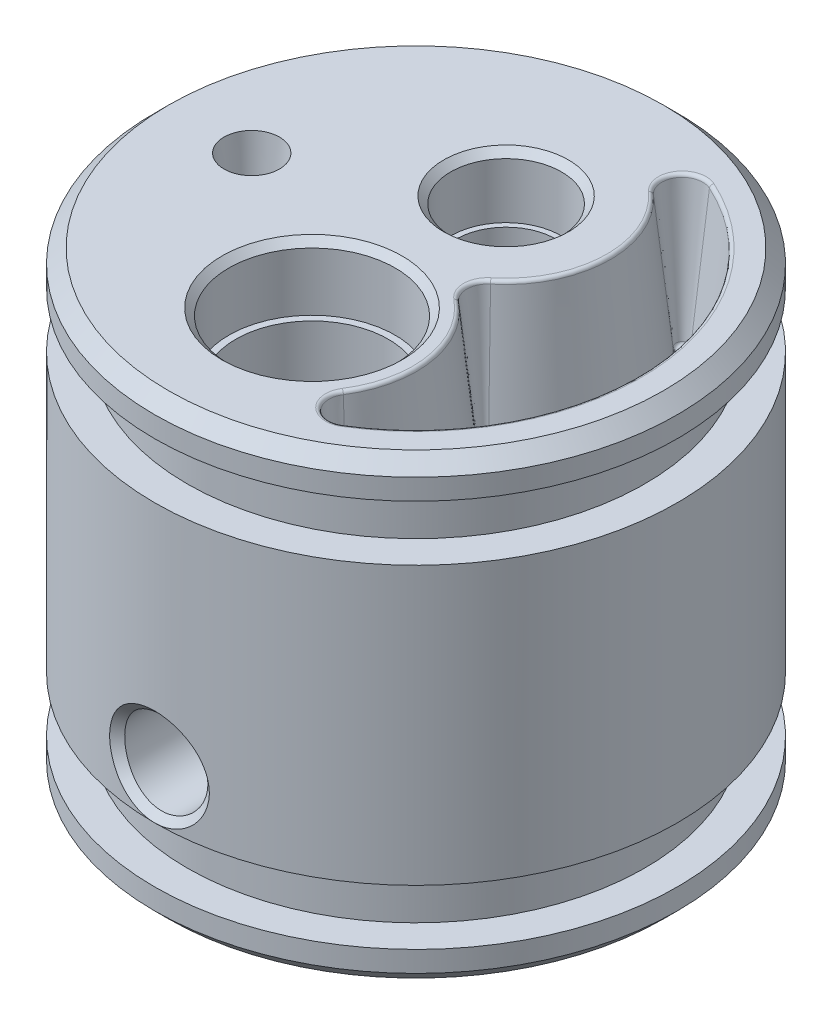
ISO-10303-21;
HEADER;
FILE_DESCRIPTION(('STEP AP214'),'2;1');
FILE_NAME('part.step','',(''),(''),'','','');
FILE_SCHEMA(('AUTOMOTIVE_DESIGN { 1 0 10303 214 1 1 1 1 }'));
ENDSEC;
DATA;
#1=APPLICATION_CONTEXT('core data for automotive mechanical design processes');
#2=APPLICATION_PROTOCOL_DEFINITION('international standard','automotive_design',2000,#1);
#3=PRODUCT_CONTEXT('',#1,'mechanical');
#4=PRODUCT('Part','Part','',(#3));
#5=PRODUCT_RELATED_PRODUCT_CATEGORY('part','',(#4));
#6=PRODUCT_DEFINITION_FORMATION('','',#4);
#7=PRODUCT_DEFINITION_CONTEXT('part definition',#1,'design');
#8=PRODUCT_DEFINITION('design','',#6,#7);
#9=PRODUCT_DEFINITION_SHAPE('','',#8);
#10=(LENGTH_UNIT() NAMED_UNIT(*) SI_UNIT(.MILLI.,.METRE.));
#11=(NAMED_UNIT(*) PLANE_ANGLE_UNIT() SI_UNIT($,.RADIAN.));
#12=(NAMED_UNIT(*) SI_UNIT($,.STERADIAN.) SOLID_ANGLE_UNIT());
#13=UNCERTAINTY_MEASURE_WITH_UNIT(LENGTH_MEASURE(1.E-05),#10,'distance_accuracy_value','');
#14=(GEOMETRIC_REPRESENTATION_CONTEXT(3) GLOBAL_UNCERTAINTY_ASSIGNED_CONTEXT((#13)) GLOBAL_UNIT_ASSIGNED_CONTEXT((#10,
#11,#12)) REPRESENTATION_CONTEXT('',''));
#15=CARTESIAN_POINT('',(0.,0.,0.));
#16=DIRECTION('',(0.,0.,1.));
#17=DIRECTION('',(1.,0.,0.));
#18=AXIS2_PLACEMENT_3D('',#15,#16,#17);
#19=CARTESIAN_POINT('',(-18.85,33.,0.));
#20=DIRECTION('',(0.,1.,0.));
#21=DIRECTION('',(0.,0.,1.));
#22=AXIS2_PLACEMENT_3D('',#19,#20,#21);
#23=PLANE('',#22);
#24=CARTESIAN_POINT('',(0.,33.,-6.5));
#25=DIRECTION('',(0.,1.,0.));
#26=DIRECTION('',(0.,0.,1.));
#27=AXIS2_PLACEMENT_3D('',#24,#25,#26);
#28=CIRCLE('',#27,7.27489898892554);
#29=CARTESIAN_POINT('',(4.57256036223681,33.,-0.841745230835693));
#30=VERTEX_POINT('',#29);
#31=CARTESIAN_POINT('',(4.86426040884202,33.,-11.9095402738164));
#32=VERTEX_POINT('',#31);
#33=EDGE_CURVE('E286',#30,#32,#28,.T.);
#34=ORIENTED_EDGE('',*,*,#33,.T.);
#35=CARTESIAN_POINT('',(6.01772529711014,33.,-13.1923076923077));
#36=DIRECTION('',(0.,1.,0.));
#37=DIRECTION('',(0.,0.,1.));
#38=AXIS2_PLACEMENT_3D('',#35,#36,#37);
#39=CIRCLE('',#38,1.72510101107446);
#40=CARTESIAN_POINT('',(6.73366902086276,33.,-14.7618293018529));
#41=VERTEX_POINT('',#40);
#42=EDGE_CURVE('E288',#32,#41,#39,.F.);
#43=ORIENTED_EDGE('',*,*,#42,.T.);
#44=CARTESIAN_POINT('',(0.,33.,0.));
#45=DIRECTION('',(0.,1.,0.));
#46=DIRECTION('',(0.,0.,1.));
#47=AXIS2_PLACEMENT_3D('',#44,#45,#46);
#48=CIRCLE('',#47,16.2251010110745);
#49=CARTESIAN_POINT('',(8.47140919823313,33.,13.8379597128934));
#50=VERTEX_POINT('',#49);
#51=EDGE_CURVE('E284',#41,#50,#48,.F.);
#52=ORIENTED_EDGE('',*,*,#51,.T.);
#53=CARTESIAN_POINT('',(7.5707037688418,33.,12.3666666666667));
#54=DIRECTION('',(0.,1.,0.));
#55=DIRECTION('',(0.,0.,1.));
#56=AXIS2_PLACEMENT_3D('',#53,#54,#55);
#57=CIRCLE('',#56,1.72510101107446);
#58=CARTESIAN_POINT('',(6.11956724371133,33.,11.4338342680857));
#59=VERTEX_POINT('',#58);
#60=EDGE_CURVE('E280',#50,#59,#57,.F.);
#61=ORIENTED_EDGE('',*,*,#60,.T.);
#62=CARTESIAN_POINT('',(0.,33.,7.5));
#63=DIRECTION('',(0.,1.,0.));
#64=DIRECTION('',(0.,0.,1.));
#65=AXIS2_PLACEMENT_3D('',#62,#63,#64);
#66=CIRCLE('',#65,7.27489898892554);
#67=CARTESIAN_POINT('',(4.5725603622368,33.,1.84174523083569));
#68=VERTEX_POINT('',#67);
#69=EDGE_CURVE('E278',#59,#68,#66,.T.);
#70=ORIENTED_EDGE('',*,*,#69,.T.);
#71=CARTESIAN_POINT('',(5.65685424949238,33.,0.5));
#72=DIRECTION('',(0.,1.,0.));
#73=DIRECTION('',(0.,0.,1.));
#74=AXIS2_PLACEMENT_3D('',#71,#72,#73);
#75=CIRCLE('',#74,1.72510101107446);
#76=EDGE_CURVE('E282',#68,#30,#75,.F.);
#77=ORIENTED_EDGE('',*,*,#76,.T.);
#78=EDGE_LOOP('',(#34,#43,#52,#61,#70,#77));
#79=FACE_BOUND('',#78,.T.);
#80=CARTESIAN_POINT('',(0.,33.,7.5));
#81=DIRECTION('',(0.,1.,0.));
#82=DIRECTION('',(0.,0.,1.));
#83=AXIS2_PLACEMENT_3D('',#80,#81,#82);
#84=CIRCLE('',#83,6.49999998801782);
#85=CARTESIAN_POINT('',(0.,33.,13.9999999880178));
#86=VERTEX_POINT('',#85);
#87=EDGE_CURVE('E420',#86,#86,#84,.F.);
#88=ORIENTED_EDGE('',*,*,#87,.T.);
#89=EDGE_LOOP('',(#88));
#90=FACE_BOUND('',#89,.T.);
#91=CARTESIAN_POINT('',(0.,33.,-6.5));
#92=DIRECTION('',(0.,1.,0.));
#93=DIRECTION('',(0.,0.,1.));
#94=AXIS2_PLACEMENT_3D('',#91,#92,#93);
#95=CIRCLE('',#94,4.49999998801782);
#96=CARTESIAN_POINT('',(0.,33.,-2.00000001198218));
#97=VERTEX_POINT('',#96);
#98=EDGE_CURVE('E416',#97,#97,#95,.F.);
#99=ORIENTED_EDGE('',*,*,#98,.T.);
#100=EDGE_LOOP('',(#99));
#101=FACE_BOUND('',#100,.T.);
#102=CARTESIAN_POINT('',(0.,33.,0.));
#103=DIRECTION('',(0.,1.,0.));
#104=DIRECTION('',(0.,0.,1.));
#105=AXIS2_PLACEMENT_3D('',#102,#103,#104);
#106=CIRCLE('',#105,17.85);
#107=CARTESIAN_POINT('',(0.,33.,17.85));
#108=VERTEX_POINT('',#107);
#109=EDGE_CURVE('E267',#108,#108,#106,.T.);
#110=ORIENTED_EDGE('',*,*,#109,.T.);
#111=EDGE_LOOP('',(#110));
#112=FACE_BOUND('',#111,.T.);
#113=CARTESIAN_POINT('',(-11.85,33.,0.));
#114=DIRECTION('',(0.,1.,0.));
#115=DIRECTION('',(-1.,0.,0.));
#116=AXIS2_PLACEMENT_3D('',#113,#114,#115);
#117=CIRCLE('',#116,2.);
#118=CARTESIAN_POINT('',(-13.85,33.,0.));
#119=VERTEX_POINT('',#118);
#120=EDGE_CURVE('E389',#119,#119,#117,.T.);
#121=ORIENTED_EDGE('',*,*,#120,.F.);
#122=EDGE_LOOP('',(#121));
#123=FACE_BOUND('',#122,.T.);
#124=ADVANCED_FACE('F29',(#79,#90,#101,#112,#123),#23,.T.);
#125=CARTESIAN_POINT('',(0.,53.,0.));
#126=DIRECTION('',(0.,1.,0.));
#127=DIRECTION('',(0.,0.,1.));
#128=AXIS2_PLACEMENT_3D('',#125,#126,#127);
#129=CYLINDRICAL_SURFACE('',#128,18.85);
#130=CARTESIAN_POINT('',(0.,32.,0.));
#131=DIRECTION('',(0.,1.,0.));
#132=DIRECTION('',(0.,0.,1.));
#133=AXIS2_PLACEMENT_3D('',#130,#131,#132);
#134=CIRCLE('',#133,18.85);
#135=CARTESIAN_POINT('',(0.,32.,18.85));
#136=VERTEX_POINT('',#135);
#137=EDGE_CURVE('E270',#136,#136,#134,.F.);
#138=ORIENTED_EDGE('',*,*,#137,.T.);
#139=EDGE_LOOP('',(#138));
#140=FACE_BOUND('',#139,.T.);
#141=CARTESIAN_POINT('',(0.,30.5,0.));
#142=DIRECTION('',(0.,1.,0.));
#143=DIRECTION('',(0.,0.,1.));
#144=AXIS2_PLACEMENT_3D('',#141,#142,#143);
#145=CIRCLE('',#144,18.85);
#146=CARTESIAN_POINT('',(0.,30.5,18.85));
#147=VERTEX_POINT('',#146);
#148=EDGE_CURVE('E432',#147,#147,#145,.T.);
#149=ORIENTED_EDGE('',*,*,#148,.T.);
#150=EDGE_LOOP('',(#149));
#151=FACE_BOUND('',#150,.T.);
#152=ADVANCED_FACE('F505',(#140,#151),#129,.T.);
#153=CARTESIAN_POINT('',(-16.5,30.5,0.));
#154=DIRECTION('',(0.,-1.,0.));
#155=DIRECTION('',(0.,0.,-1.));
#156=AXIS2_PLACEMENT_3D('',#153,#154,#155);
#157=PLANE('',#156);
#158=CARTESIAN_POINT('',(0.,30.5,0.));
#159=DIRECTION('',(0.,1.,0.));
#160=DIRECTION('',(0.,0.,1.));
#161=AXIS2_PLACEMENT_3D('',#158,#159,#160);
#162=CIRCLE('',#161,16.5);
#163=CARTESIAN_POINT('',(0.,30.5,16.5));
#164=VERTEX_POINT('',#163);
#165=EDGE_CURVE('E436',#164,#164,#162,.T.);
#166=ORIENTED_EDGE('',*,*,#165,.T.);
#167=EDGE_LOOP('',(#166));
#168=FACE_BOUND('',#167,.T.);
#169=ORIENTED_EDGE('',*,*,#148,.F.);
#170=EDGE_LOOP('',(#169));
#171=FACE_BOUND('',#170,.T.);
#172=ADVANCED_FACE('F503',(#168,#171),#157,.T.);
#173=CARTESIAN_POINT('',(0.,53.,0.));
#174=DIRECTION('',(0.,1.,0.));
#175=DIRECTION('',(0.,0.,1.));
#176=AXIS2_PLACEMENT_3D('',#173,#174,#175);
#177=CYLINDRICAL_SURFACE('',#176,16.5);
#178=CARTESIAN_POINT('',(0.,26.5,0.));
#179=DIRECTION('',(0.,1.,0.));
#180=DIRECTION('',(0.,0.,1.));
#181=AXIS2_PLACEMENT_3D('',#178,#179,#180);
#182=CIRCLE('',#181,16.5);
#183=CARTESIAN_POINT('',(0.,26.5,16.5));
#184=VERTEX_POINT('',#183);
#185=EDGE_CURVE('E441',#184,#184,#182,.T.);
#186=ORIENTED_EDGE('',*,*,#185,.T.);
#187=EDGE_LOOP('',(#186));
#188=FACE_BOUND('',#187,.T.);
#189=ORIENTED_EDGE('',*,*,#165,.F.);
#190=EDGE_LOOP('',(#189));
#191=FACE_BOUND('',#190,.T.);
#192=ADVANCED_FACE('F495',(#188,#191),#177,.T.);
#193=CARTESIAN_POINT('',(-18.85,26.5,0.));
#194=DIRECTION('',(0.,1.,0.));
#195=DIRECTION('',(0.,0.,1.));
#196=AXIS2_PLACEMENT_3D('',#193,#194,#195);
#197=PLANE('',#196);
#198=CARTESIAN_POINT('',(0.,26.5,0.));
#199=DIRECTION('',(0.,1.,0.));
#200=DIRECTION('',(0.,0.,1.));
#201=AXIS2_PLACEMENT_3D('',#198,#199,#200);
#202=CIRCLE('',#201,18.85);
#203=CARTESIAN_POINT('',(0.,26.5,18.85));
#204=VERTEX_POINT('',#203);
#205=EDGE_CURVE('E214',#204,#204,#202,.T.);
#206=ORIENTED_EDGE('',*,*,#205,.T.);
#207=EDGE_LOOP('',(#206));
#208=FACE_BOUND('',#207,.T.);
#209=ORIENTED_EDGE('',*,*,#185,.F.);
#210=EDGE_LOOP('',(#209));
#211=FACE_BOUND('',#210,.T.);
#212=ADVANCED_FACE('F239',(#208,#211),#197,.T.);
#213=CARTESIAN_POINT('',(0.,53.,0.));
#214=DIRECTION('',(0.,1.,0.));
#215=DIRECTION('',(0.,0.,1.));
#216=AXIS2_PLACEMENT_3D('',#213,#214,#215);
#217=CYLINDRICAL_SURFACE('',#216,18.85);
#218=CARTESIAN_POINT('',(0.,6.50000000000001,0.));
#219=DIRECTION('',(0.,1.,0.));
#220=DIRECTION('',(0.,0.,1.));
#221=AXIS2_PLACEMENT_3D('',#218,#219,#220);
#222=CIRCLE('',#221,18.85);
#223=CARTESIAN_POINT('',(-0.000586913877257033,6.50000000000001,-18.8499999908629));
#224=VERTEX_POINT('',#223);
#225=CARTESIAN_POINT('',(0.,6.50000000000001,18.85));
#226=VERTEX_POINT('',#225);
#227=EDGE_CURVE('E215',#224,#226,#222,.T.);
#228=ORIENTED_EDGE('',*,*,#227,.T.);
#229=CARTESIAN_POINT('',(0.,6.50000001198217,18.85));
#230=CARTESIAN_POINT('',(0.945702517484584,6.50021839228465,18.8499646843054));
#231=CARTESIAN_POINT('',(1.87782172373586,6.87918746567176,18.7698727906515));
#232=CARTESIAN_POINT('',(3.20715860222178,8.17141787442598,18.5856217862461));
#233=CARTESIAN_POINT('',(3.59562067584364,9.07883050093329,18.5039134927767));
#234=CARTESIAN_POINT('',(3.59511427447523,10.9180577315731,18.5039685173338));
#235=CARTESIAN_POINT('',(3.20839991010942,11.8260971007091,18.5854543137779));
#236=CARTESIAN_POINT('',(1.87861463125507,13.1213162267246,18.7697633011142));
#237=CARTESIAN_POINT('',(0.949686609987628,13.4998385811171,18.8499790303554));
#238=CARTESIAN_POINT('',(-0.949633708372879,13.5001613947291,18.8500209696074));
#239=CARTESIAN_POINT('',(-1.87774438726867,13.1220065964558,18.7698707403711));
#240=CARTESIAN_POINT('',(-3.2077015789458,11.8269346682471,18.585560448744));
#241=CARTESIAN_POINT('',(-3.59520401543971,10.9178889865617,18.5039438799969));
#242=CARTESIAN_POINT('',(-3.59553041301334,9.07801279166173,18.5039382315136));
#243=CARTESIAN_POINT('',(-3.20697135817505,8.17164821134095,18.5856098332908));
#244=CARTESIAN_POINT('',(-1.87832489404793,6.87926473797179,18.7698417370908));
#245=CARTESIAN_POINT('',(-0.945702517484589,6.49978163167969,18.8500353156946));
#246=CARTESIAN_POINT('',(0.,6.50000001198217,18.85));
#247=B_SPLINE_CURVE_WITH_KNOTS('',3,(#229,#230,#231,#232,#233,#234,#235,#236,#237,#238,#239,
#240,#241,#242,#243,#244,#245,#246),.UNSPECIFIED.,.T.,.F.,(4,2,2,2,2,2,2,2,4),
(-0.0219193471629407,-0.0191774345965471,-0.0164355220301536,-0.01369360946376,
-0.0109516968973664,-0.00820978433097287,-0.00546787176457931,-0.00272595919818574,
1.59533682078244E-05),.UNSPECIFIED.);
#248=EDGE_CURVE('E122',#226,#226,#247,.F.);
#249=ORIENTED_EDGE('',*,*,#248,.T.);
#250=EDGE_CURVE('E207',#226,#224,#222,.T.);
#251=ORIENTED_EDGE('',*,*,#250,.T.);
#252=CARTESIAN_POINT('',(0.,13.4999999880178,-18.85));
#253=CARTESIAN_POINT('',(0.945702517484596,13.4997816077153,-18.8499646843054));
#254=CARTESIAN_POINT('',(1.87782172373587,13.1208125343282,-18.7698727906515));
#255=CARTESIAN_POINT('',(3.20715860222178,11.828582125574,-18.5856217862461));
#256=CARTESIAN_POINT('',(3.59562067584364,10.9211694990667,-18.5039134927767));
#257=CARTESIAN_POINT('',(3.59511427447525,9.0819422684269,-18.5039685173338));
#258=CARTESIAN_POINT('',(3.20839991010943,8.1739028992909,-18.5854543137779));
#259=CARTESIAN_POINT('',(1.87861463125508,6.87868377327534,-18.7697633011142));
#260=CARTESIAN_POINT('',(0.949686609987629,6.50016141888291,-18.8499790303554));
#261=CARTESIAN_POINT('',(-0.949633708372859,6.49983860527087,-18.8500209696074));
#262=CARTESIAN_POINT('',(-1.87774438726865,6.8779934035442,-18.7698707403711));
#263=CARTESIAN_POINT('',(-3.20770157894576,8.17306533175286,-18.585560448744));
#264=CARTESIAN_POINT('',(-3.59520401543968,9.08211101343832,-18.5039438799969));
#265=CARTESIAN_POINT('',(-3.59553041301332,10.9219872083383,-18.5039382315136));
#266=CARTESIAN_POINT('',(-3.20697135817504,11.828351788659,-18.5856098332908));
#267=CARTESIAN_POINT('',(-1.87832489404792,13.1207352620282,-18.7698417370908));
#268=CARTESIAN_POINT('',(-0.945702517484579,13.5002183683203,-18.8500353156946));
#269=CARTESIAN_POINT('',(0.,13.4999999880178,-18.85));
#270=B_SPLINE_CURVE_WITH_KNOTS('',3,(#252,#253,#254,#255,#256,#257,#258,#259,#260,#261,#262,
#263,#264,#265,#266,#267,#268,#269),.UNSPECIFIED.,.T.,.F.,(4,2,2,2,2,2,2,2,4),
(-0.0219193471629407,-0.0191774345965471,-0.0164355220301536,-0.01369360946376,
-0.0109516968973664,-0.00820978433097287,-0.0054678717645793,-0.00272595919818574,
1.59533682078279E-05),.UNSPECIFIED.);
#271=EDGE_CURVE('E131',#224,#224,#270,.F.);
#272=ORIENTED_EDGE('',*,*,#271,.T.);
#273=EDGE_LOOP('',(#228,#249,#251,#272));
#274=FACE_BOUND('',#273,.T.);
#275=ORIENTED_EDGE('',*,*,#205,.F.);
#276=EDGE_LOOP('',(#275));
#277=FACE_BOUND('',#276,.T.);
#278=ADVANCED_FACE('F228',(#274,#277),#217,.T.);
#279=CARTESIAN_POINT('',(-16.5,6.49999999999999,0.));
#280=DIRECTION('',(0.,-1.,0.));
#281=DIRECTION('',(0.,0.,-1.));
#282=AXIS2_PLACEMENT_3D('',#279,#280,#281);
#283=PLANE('',#282);
#284=CARTESIAN_POINT('',(0.,6.50000000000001,0.));
#285=DIRECTION('',(0.,1.,0.));
#286=DIRECTION('',(0.,0.,1.));
#287=AXIS2_PLACEMENT_3D('',#284,#285,#286);
#288=CIRCLE('',#287,16.5);
#289=CARTESIAN_POINT('',(0.,6.50000000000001,16.5));
#290=VERTEX_POINT('',#289);
#291=EDGE_CURVE('E220',#290,#290,#288,.T.);
#292=ORIENTED_EDGE('',*,*,#291,.T.);
#293=EDGE_LOOP('',(#292));
#294=FACE_BOUND('',#293,.T.);
#295=ORIENTED_EDGE('',*,*,#250,.F.);
#296=ORIENTED_EDGE('',*,*,#227,.F.);
#297=EDGE_LOOP('',(#295,#296));
#298=FACE_BOUND('',#297,.T.);
#299=ADVANCED_FACE('F238',(#294,#298),#283,.T.);
#300=CARTESIAN_POINT('',(0.,53.,0.));
#301=DIRECTION('',(0.,1.,0.));
#302=DIRECTION('',(0.,0.,1.));
#303=AXIS2_PLACEMENT_3D('',#300,#301,#302);
#304=CYLINDRICAL_SURFACE('',#303,16.5);
#305=CARTESIAN_POINT('',(0.,2.5,0.));
#306=DIRECTION('',(0.,1.,0.));
#307=DIRECTION('',(0.,0.,1.));
#308=AXIS2_PLACEMENT_3D('',#305,#306,#307);
#309=CIRCLE('',#308,16.5);
#310=CARTESIAN_POINT('',(0.,2.5,16.5));
#311=VERTEX_POINT('',#310);
#312=EDGE_CURVE('E486',#311,#311,#309,.T.);
#313=ORIENTED_EDGE('',*,*,#312,.T.);
#314=EDGE_LOOP('',(#313));
#315=FACE_BOUND('',#314,.T.);
#316=ORIENTED_EDGE('',*,*,#291,.F.);
#317=EDGE_LOOP('',(#316));
#318=FACE_BOUND('',#317,.T.);
#319=ADVANCED_FACE('F564',(#315,#318),#304,.T.);
#320=CARTESIAN_POINT('',(-18.85,2.49999999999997,0.));
#321=DIRECTION('',(0.,1.,0.));
#322=DIRECTION('',(0.,0.,1.));
#323=AXIS2_PLACEMENT_3D('',#320,#321,#322);
#324=PLANE('',#323);
#325=CARTESIAN_POINT('',(0.,2.5,0.));
#326=DIRECTION('',(0.,1.,0.));
#327=DIRECTION('',(0.,0.,1.));
#328=AXIS2_PLACEMENT_3D('',#325,#326,#327);
#329=CIRCLE('',#328,18.85);
#330=CARTESIAN_POINT('',(0.,2.5,18.85));
#331=VERTEX_POINT('',#330);
#332=EDGE_CURVE('E483',#331,#331,#329,.T.);
#333=ORIENTED_EDGE('',*,*,#332,.T.);
#334=EDGE_LOOP('',(#333));
#335=FACE_BOUND('',#334,.T.);
#336=ORIENTED_EDGE('',*,*,#312,.F.);
#337=EDGE_LOOP('',(#336));
#338=FACE_BOUND('',#337,.T.);
#339=ADVANCED_FACE('F558',(#335,#338),#324,.T.);
#340=CARTESIAN_POINT('',(0.,53.,0.));
#341=DIRECTION('',(0.,1.,0.));
#342=DIRECTION('',(0.,0.,1.));
#343=AXIS2_PLACEMENT_3D('',#340,#341,#342);
#344=CYLINDRICAL_SURFACE('',#343,18.85);
#345=CARTESIAN_POINT('',(0.,1.00000000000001,0.));
#346=DIRECTION('',(0.,-1.,0.));
#347=DIRECTION('',(0.,0.,-1.));
#348=AXIS2_PLACEMENT_3D('',#345,#346,#347);
#349=CIRCLE('',#348,18.85);
#350=CARTESIAN_POINT('',(0.,1.00000000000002,-18.85));
#351=VERTEX_POINT('',#350);
#352=EDGE_CURVE('E256',#351,#351,#349,.F.);
#353=ORIENTED_EDGE('',*,*,#352,.T.);
#354=EDGE_LOOP('',(#353));
#355=FACE_BOUND('',#354,.T.);
#356=ORIENTED_EDGE('',*,*,#332,.F.);
#357=EDGE_LOOP('',(#356));
#358=FACE_BOUND('',#357,.T.);
#359=ADVANCED_FACE('F554',(#355,#358),#344,.T.);
#360=CARTESIAN_POINT('',(0.,0.,0.));
#361=DIRECTION('',(0.,-1.,0.));
#362=DIRECTION('',(0.,0.,-1.));
#363=AXIS2_PLACEMENT_3D('',#360,#361,#362);
#364=PLANE('',#363);
#365=CARTESIAN_POINT('',(0.,0.,0.));
#366=DIRECTION('',(0.,-1.,0.));
#367=DIRECTION('',(0.,0.,-1.));
#368=AXIS2_PLACEMENT_3D('',#365,#366,#367);
#369=CIRCLE('',#368,17.85);
#370=CARTESIAN_POINT('',(0.,0.,-17.85));
#371=VERTEX_POINT('',#370);
#372=EDGE_CURVE('E264',#371,#371,#369,.T.);
#373=ORIENTED_EDGE('',*,*,#372,.T.);
#374=EDGE_LOOP('',(#373));
#375=FACE_BOUND('',#374,.T.);
#376=CARTESIAN_POINT('',(0.,0.,0.));
#377=DIRECTION('',(0.,-1.,0.));
#378=DIRECTION('',(0.,0.,-1.));
#379=AXIS2_PLACEMENT_3D('',#376,#377,#378);
#380=CIRCLE('',#379,11.2999999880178);
#381=CARTESIAN_POINT('',(0.,0.,-11.2999999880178));
#382=VERTEX_POINT('',#381);
#383=EDGE_CURVE('E428',#382,#382,#380,.F.);
#384=ORIENTED_EDGE('',*,*,#383,.T.);
#385=EDGE_LOOP('',(#384));
#386=FACE_BOUND('',#385,.T.);
#387=ADVANCED_FACE('F557',(#375,#386),#364,.T.);
#388=CARTESIAN_POINT('',(0.,18.5,0.));
#389=DIRECTION('',(0.,-1.,0.));
#390=DIRECTION('',(0.,0.,-1.));
#391=AXIS2_PLACEMENT_3D('',#388,#389,#390);
#392=CYLINDRICAL_SURFACE('',#391,10.8);
#393=CARTESIAN_POINT('',(0.,0.499999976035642,0.));
#394=DIRECTION('',(0.,-1.,0.));
#395=DIRECTION('',(0.,0.,-1.));
#396=AXIS2_PLACEMENT_3D('',#393,#394,#395);
#397=CIRCLE('',#396,10.8);
#398=CARTESIAN_POINT('',(0.,0.499999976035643,-10.8));
#399=VERTEX_POINT('',#398);
#400=EDGE_CURVE('E430',#399,#399,#397,.T.);
#401=ORIENTED_EDGE('',*,*,#400,.T.);
#402=EDGE_LOOP('',(#401));
#403=FACE_BOUND('',#402,.T.);
#404=CARTESIAN_POINT('',(0.,13.,-10.8));
#405=CARTESIAN_POINT('',(0.165123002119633,12.9999966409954,-10.7999977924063));
#406=CARTESIAN_POINT('',(0.330281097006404,12.9863216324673,-10.7961761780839));
#407=CARTESIAN_POINT('',(0.655822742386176,12.9320902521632,-10.7813028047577));
#408=CARTESIAN_POINT('',(0.816204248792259,12.8915225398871,-10.7702479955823));
#409=CARTESIAN_POINT('',(1.12744787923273,12.7849390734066,-10.7421255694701));
#410=CARTESIAN_POINT('',(1.2783225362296,12.7189576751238,-10.7250660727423));
#411=CARTESIAN_POINT('',(1.56686566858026,12.5635515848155,-10.6867275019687));
#412=CARTESIAN_POINT('',(1.70453296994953,12.4741248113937,-10.6654480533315));
#413=CARTESIAN_POINT('',(1.96619228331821,12.2720093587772,-10.6203637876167));
#414=CARTESIAN_POINT('',(2.08980747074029,12.1588431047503,-10.5965129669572));
#415=CARTESIAN_POINT('',(2.31657164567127,11.9134809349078,-10.5492625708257));
#416=CARTESIAN_POINT('',(2.41971775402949,11.781282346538,-10.5258630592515));
#417=CARTESIAN_POINT('',(2.60449940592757,11.4985425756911,-10.4816890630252));
#418=CARTESIAN_POINT('',(2.68569299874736,11.3477026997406,-10.4609723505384));
#419=CARTESIAN_POINT('',(2.8214149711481,11.0338433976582,-10.4251896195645));
#420=CARTESIAN_POINT('',(2.87594873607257,10.8708264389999,-10.4101224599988));
#421=CARTESIAN_POINT('',(2.95547818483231,10.5414333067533,-10.3878211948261));
#422=CARTESIAN_POINT('',(2.98116088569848,10.3752356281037,-10.3804052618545));
#423=CARTESIAN_POINT('',(3.00440224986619,10.0407378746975,-10.3737035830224));
#424=CARTESIAN_POINT('',(3.00196665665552,9.87243823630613,-10.3744161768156));
#425=CARTESIAN_POINT('',(2.96958411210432,9.54394653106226,-10.3837288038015));
#426=CARTESIAN_POINT('',(2.94047765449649,9.38366367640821,-10.3920878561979));
#427=CARTESIAN_POINT('',(2.85692954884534,9.07035129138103,-10.4153644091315));
#428=CARTESIAN_POINT('',(2.80248572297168,8.91732238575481,-10.4302824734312));
#429=CARTESIAN_POINT('',(2.66914495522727,8.62071464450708,-10.4652016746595));
#430=CARTESIAN_POINT('',(2.58996052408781,8.4772723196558,-10.4852620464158));
#431=CARTESIAN_POINT('',(2.40958657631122,8.20542021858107,-10.5281748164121));
#432=CARTESIAN_POINT('',(2.30839239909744,8.07701363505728,-10.5510278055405));
#433=CARTESIAN_POINT('',(2.08261346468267,7.83408668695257,-10.597945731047));
#434=CARTESIAN_POINT('',(1.95732547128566,7.72022167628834,-10.6220248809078));
#435=CARTESIAN_POINT('',(1.68913585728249,7.51497824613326,-10.667956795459));
#436=CARTESIAN_POINT('',(1.54623342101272,7.42360086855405,-10.6898094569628));
#437=CARTESIAN_POINT('',(1.24580023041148,7.26560364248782,-10.7289801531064));
#438=CARTESIAN_POINT('',(1.0881993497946,7.19911095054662,-10.7462747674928));
#439=CARTESIAN_POINT('',(0.763463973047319,7.09375816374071,-10.7742118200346));
#440=CARTESIAN_POINT('',(0.596331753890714,7.05489149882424,-10.7848558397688));
#441=CARTESIAN_POINT('',(0.262863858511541,7.00694287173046,-10.7980496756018));
#442=CARTESIAN_POINT('',(0.0966655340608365,6.99697085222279,-10.8008412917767));
#443=CARTESIAN_POINT('',(-0.235031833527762,7.00462479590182,-10.7987155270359));
#444=CARTESIAN_POINT('',(-0.400530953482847,7.02224764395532,-10.7937990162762));
#445=CARTESIAN_POINT('',(-0.722896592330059,7.08386400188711,-10.7769663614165));
#446=CARTESIAN_POINT('',(-0.879867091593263,7.127353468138,-10.7651840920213));
#447=CARTESIAN_POINT('',(-1.18426348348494,7.23887648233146,-10.7359639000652));
#448=CARTESIAN_POINT('',(-1.33168829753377,7.30691279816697,-10.7185253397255));
#449=CARTESIAN_POINT('',(-1.61620833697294,7.46719810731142,-10.6793697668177));
#450=CARTESIAN_POINT('',(-1.75302494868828,7.5599212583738,-10.6575713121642));
#451=CARTESIAN_POINT('',(-2.00946640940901,7.7663587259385,-10.6122114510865));
#452=CARTESIAN_POINT('',(-2.12908755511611,7.88007755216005,-10.5886496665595));
#453=CARTESIAN_POINT('',(-2.35154886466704,8.12944346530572,-10.5415162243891));
#454=CARTESIAN_POINT('',(-2.45375898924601,8.26565788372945,-10.5179665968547));
#455=CARTESIAN_POINT('',(-2.63389395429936,8.55380953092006,-10.4743126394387));
#456=CARTESIAN_POINT('',(-2.71181972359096,8.70574615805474,-10.4542081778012));
#457=CARTESIAN_POINT('',(-2.84059454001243,9.02033720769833,-10.4199551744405));
#458=CARTESIAN_POINT('',(-2.89159385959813,9.18292633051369,-10.4057736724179));
#459=CARTESIAN_POINT('',(-2.96538365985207,9.5148393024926,-10.3849890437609));
#460=CARTESIAN_POINT('',(-2.98818210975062,9.68416123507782,-10.3783837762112));
#461=CARTESIAN_POINT('',(-3.00443663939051,10.0182538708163,-10.3736889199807));
#462=CARTESIAN_POINT('',(-2.99890970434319,10.1829716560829,-10.3753041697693));
#463=CARTESIAN_POINT('',(-2.96105143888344,10.509027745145,-10.386171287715));
#464=CARTESIAN_POINT('',(-2.92872091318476,10.6703661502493,-10.3954229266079));
#465=CARTESIAN_POINT('',(-2.83878538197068,10.9836813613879,-10.4203372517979));
#466=CARTESIAN_POINT('',(-2.78141315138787,11.1357300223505,-10.4359408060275));
#467=CARTESIAN_POINT('',(-2.64320284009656,11.4281618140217,-10.4717979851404));
#468=CARTESIAN_POINT('',(-2.56236080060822,11.5685429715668,-10.4920523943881));
#469=CARTESIAN_POINT('',(-2.37649670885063,11.8384663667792,-10.5357314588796));
#470=CARTESIAN_POINT('',(-2.27078900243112,11.9675235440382,-10.5592362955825));
#471=CARTESIAN_POINT('',(-2.03947566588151,12.2063976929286,-10.6063399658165));
#472=CARTESIAN_POINT('',(-1.91386510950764,12.3162098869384,-10.6299388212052));
#473=CARTESIAN_POINT('',(-1.64270455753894,12.5160595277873,-10.6752441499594));
#474=CARTESIAN_POINT('',(-1.49675102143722,12.6055638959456,-10.6968921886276));
#475=CARTESIAN_POINT('',(-1.19126875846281,12.7586275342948,-10.7351993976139));
#476=CARTESIAN_POINT('',(-1.03174807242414,12.8222020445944,-10.7518614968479));
#477=CARTESIAN_POINT('',(-0.727549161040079,12.9141281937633,-10.7763857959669));
#478=CARTESIAN_POINT('',(-0.584074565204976,12.9462514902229,-10.7851738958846));
#479=CARTESIAN_POINT('',(-0.293742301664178,12.9891876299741,-10.7969816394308));
#480=CARTESIAN_POINT('',(-0.146885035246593,13.0000029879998,-10.8000019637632));
#481=CARTESIAN_POINT('',(0.,13.,-10.8));
#482=B_SPLINE_CURVE_WITH_KNOTS('',3,(#404,#405,#406,#407,#408,#409,#410,#411,#412,#413,#414,
#415,#416,#417,#418,#419,#420,#421,#422,#423,#424,#425,#426,#427,#428,#429,#430,#431,#432,#433,
#434,#435,#436,#437,#438,#439,#440,#441,#442,#443,#444,#445,#446,#447,#448,#449,#450,#451,#452,
#453,#454,#455,#456,#457,#458,#459,#460,#461,#462,#463,#464,#465,#466,#467,#468,#469,#470,#471,
#472,#473,#474,#475,#476,#477,#478,#479,#480,#481),.UNSPECIFIED.,.T.,.F.,(4,2,2,2,2,2,2,2,2,2,2,
2,2,2,2,2,2,2,2,2,2,2,2,2,2,2,2,2,2,2,2,2,2,2,2,2,2,2,4),(0.,0.494830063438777,
0.989868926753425,1.48424089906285,1.97865677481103,2.48418298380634,2.98978024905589,
3.50490456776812,4.01992478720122,4.52240236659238,5.02477731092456,5.51184559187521,
5.99895574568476,6.49195104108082,6.98505083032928,7.49566785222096,8.00630852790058,
8.51952397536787,9.03261732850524,9.52972825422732,10.0267830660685,10.5144556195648,
11.002183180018,11.5000547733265,11.9980334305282,12.5113438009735,13.0246345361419,
13.5350295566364,14.045280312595,14.5373423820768,15.0293896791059,15.5169574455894,
16.0046075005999,16.5077259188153,17.0109690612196,17.5261941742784,18.041116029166,
18.4813436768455,18.9215193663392),.UNSPECIFIED.);
#483=CARTESIAN_POINT('',(0.,13.,-10.8));
#484=VERTEX_POINT('',#483);
#485=EDGE_CURVE('E196',#484,#484,#482,.T.);
#486=ORIENTED_EDGE('',*,*,#485,.T.);
#487=EDGE_LOOP('',(#486));
#488=FACE_BOUND('',#487,.T.);
#489=CARTESIAN_POINT('',(3.,9.99999999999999,10.3749698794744));
#490=CARTESIAN_POINT('',(2.9999965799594,10.1649843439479,10.374972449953));
#491=CARTESIAN_POINT('',(2.98634372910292,10.3300038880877,10.3789483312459));
#492=CARTESIAN_POINT('',(2.93220832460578,10.6552583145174,10.3943696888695));
#493=CARTESIAN_POINT('',(2.89171378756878,10.8154910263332,10.4058185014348));
#494=CARTESIAN_POINT('',(2.78534410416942,11.1264187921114,10.4347912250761));
#495=CARTESIAN_POINT('',(2.71950671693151,11.2771276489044,10.4523060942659));
#496=CARTESIAN_POINT('',(2.56444052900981,11.5653891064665,10.4914257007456));
#497=CARTESIAN_POINT('',(2.47520935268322,11.7029403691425,10.5130308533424));
#498=CARTESIAN_POINT('',(2.27329838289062,11.9647142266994,10.5585537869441));
#499=CARTESIAN_POINT('',(2.16009693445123,12.0885269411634,10.5825153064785));
#500=CARTESIAN_POINT('',(1.91457944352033,12.3156770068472,10.6296748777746));
#501=CARTESIAN_POINT('',(1.78226127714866,12.419012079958,10.6528728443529));
#502=CARTESIAN_POINT('',(1.49940051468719,12.6040053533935,10.6963824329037));
#503=CARTESIAN_POINT('',(1.34857959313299,12.6852527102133,10.7166364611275));
#504=CARTESIAN_POINT('',(1.0347604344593,12.8210791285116,10.7514722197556));
#505=CARTESIAN_POINT('',(0.871764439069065,12.8756630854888,10.7660549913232));
#506=CARTESIAN_POINT('',(0.542503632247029,12.9552771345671,10.787595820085));
#507=CARTESIAN_POINT('',(0.376419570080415,12.9810052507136,10.7947336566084));
#508=CARTESIAN_POINT('',(0.0421493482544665,13.0043769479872,10.8012104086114));
#509=CARTESIAN_POINT('',(-0.126036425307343,13.002025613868,10.8005507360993));
#510=CARTESIAN_POINT('',(-0.454865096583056,12.9697893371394,10.7916370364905));
#511=CARTESIAN_POINT('',(-0.615588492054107,12.9406590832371,10.7835911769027));
#512=CARTESIAN_POINT('',(-0.929768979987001,12.8569154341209,10.7610571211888));
#513=CARTESIAN_POINT('',(-1.08322564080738,12.8023005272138,10.7465685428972));
#514=CARTESIAN_POINT('',(-1.38040031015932,12.6685815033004,10.7124750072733));
#515=CARTESIAN_POINT('',(-1.52399883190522,12.5892257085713,10.6928178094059));
#516=CARTESIAN_POINT('',(-1.79609348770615,12.4084724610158,10.6504946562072));
#517=CARTESIAN_POINT('',(-1.92458645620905,12.3070704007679,10.6278280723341));
#518=CARTESIAN_POINT('',(-2.16732811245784,12.0811256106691,10.5810439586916));
#519=CARTESIAN_POINT('',(-2.28096150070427,11.9559258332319,10.5569032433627));
#520=CARTESIAN_POINT('',(-2.48577729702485,11.6880007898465,10.5105645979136));
#521=CARTESIAN_POINT('',(-2.57695808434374,11.5452742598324,10.4883668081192));
#522=CARTESIAN_POINT('',(-2.73480285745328,11.2449223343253,10.4483281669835));
#523=CARTESIAN_POINT('',(-2.80128601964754,11.0871972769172,10.4305197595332));
#524=CARTESIAN_POINT('',(-2.90658357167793,10.7621876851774,10.4016722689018));
#525=CARTESIAN_POINT('',(-2.94540550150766,10.5949057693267,10.3906313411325));
#526=CARTESIAN_POINT('',(-2.99318946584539,10.2613185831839,10.3769657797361));
#527=CARTESIAN_POINT('',(-3.00307499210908,10.0951561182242,10.374080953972));
#528=CARTESIAN_POINT('',(-2.99526110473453,9.76354961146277,10.3763398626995));
#529=CARTESIAN_POINT('',(-2.97756491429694,9.59810548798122,10.3814826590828));
#530=CARTESIAN_POINT('',(-2.91590689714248,9.27628270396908,10.3989646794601));
#531=CARTESIAN_POINT('',(-2.87251271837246,9.119785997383,10.4111482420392));
#532=CARTESIAN_POINT('',(-2.76133511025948,8.81629572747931,10.4411839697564));
#533=CARTESIAN_POINT('',(-2.69354830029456,8.66930348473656,10.4590369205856));
#534=CARTESIAN_POINT('',(-2.53367485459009,8.38516555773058,10.4989243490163));
#535=CARTESIAN_POINT('',(-2.44105280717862,8.24833387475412,10.5210475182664));
#536=CARTESIAN_POINT('',(-2.23479266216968,7.99181650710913,10.5667799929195));
#537=CARTESIAN_POINT('',(-2.12115026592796,7.87213433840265,10.5903896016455));
#538=CARTESIAN_POINT('',(-1.87178092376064,7.64941423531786,10.6373402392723));
#539=CARTESIAN_POINT('',(-1.73546831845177,7.54702382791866,10.6606490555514));
#540=CARTESIAN_POINT('',(-1.44705973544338,7.36657123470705,10.7036088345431));
#541=CARTESIAN_POINT('',(-1.2949645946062,7.28850775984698,10.7232599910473));
#542=CARTESIAN_POINT('',(-0.98037407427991,7.15966048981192,10.7565639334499));
#543=CARTESIAN_POINT('',(-0.817968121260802,7.10867060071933,10.7702618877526));
#544=CARTESIAN_POINT('',(-0.486451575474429,7.03483819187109,10.7903153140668));
#545=CARTESIAN_POINT('',(-0.317342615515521,7.01198886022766,10.7966725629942));
#546=CARTESIAN_POINT('',(0.0167521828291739,6.99554280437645,10.801236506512));
#547=CARTESIAN_POINT('',(0.181688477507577,7.00099995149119,10.799706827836));
#548=CARTESIAN_POINT('',(0.50820074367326,7.03879427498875,10.789273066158));
#549=CARTESIAN_POINT('',(0.669776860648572,7.07113028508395,10.7803693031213));
#550=CARTESIAN_POINT('',(0.983741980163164,7.16121186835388,10.7562478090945));
#551=CARTESIAN_POINT('',(1.13619438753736,7.2187511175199,10.7410814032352));
#552=CARTESIAN_POINT('',(1.42936704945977,7.35742232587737,10.7060138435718));
#553=CARTESIAN_POINT('',(1.57008555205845,7.43855780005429,10.6861119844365));
#554=CARTESIAN_POINT('',(1.8401413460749,7.62480633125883,10.6429847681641));
#555=CARTESIAN_POINT('',(1.9690407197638,7.73053610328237,10.6196809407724));
#556=CARTESIAN_POINT('',(2.20758676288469,7.96182151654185,10.572671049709));
#557=CARTESIAN_POINT('',(2.31722821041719,8.08738251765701,10.5489648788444));
#558=CARTESIAN_POINT('',(2.51681090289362,8.35845342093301,10.5031626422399));
#559=CARTESIAN_POINT('',(2.60620556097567,8.50437566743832,10.4811200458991));
#560=CARTESIAN_POINT('',(2.75907183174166,8.8097727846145,10.4419246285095));
#561=CARTESIAN_POINT('',(2.82255901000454,8.96923944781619,10.4247688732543));
#562=CARTESIAN_POINT('',(2.91431393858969,9.27323215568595,10.399456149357));
#563=CARTESIAN_POINT('',(2.94636676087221,9.4165472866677,10.3903519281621));
#564=CARTESIAN_POINT('',(2.98920984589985,9.70656597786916,10.3781080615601));
#565=CARTESIAN_POINT('',(3.00000304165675,9.8532690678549,10.3749675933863));
#566=CARTESIAN_POINT('',(3.,9.99999999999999,10.3749698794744));
#567=B_SPLINE_CURVE_WITH_KNOTS('',3,(#489,#490,#491,#492,#493,#494,#495,#496,#497,#498,#499,
#500,#501,#502,#503,#504,#505,#506,#507,#508,#509,#510,#511,#512,#513,#514,#515,#516,#517,#518,
#519,#520,#521,#522,#523,#524,#525,#526,#527,#528,#529,#530,#531,#532,#533,#534,#535,#536,#537,
#538,#539,#540,#541,#542,#543,#544,#545,#546,#547,#548,#549,#550,#551,#552,#553,#554,#555,#556,
#557,#558,#559,#560,#561,#562,#563,#564,#565,#566),.UNSPECIFIED.,.T.,.F.,(4,2,2,2,2,2,2,2,2,2,2,
2,2,2,2,2,2,2,2,2,2,2,2,2,2,2,2,2,2,2,2,2,2,2,2,2,2,2,4),(0.,0.49441295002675,0.989046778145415,
1.48294647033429,1.9768963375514,2.48296674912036,2.98909342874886,3.50407436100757,
4.01896070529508,4.52110357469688,5.02315551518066,5.51147841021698,5.99983027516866,
6.49332159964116,6.98691615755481,7.4969145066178,8.00694965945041,8.52064868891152,
9.03420763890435,9.53118765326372,10.0281095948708,10.5144441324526,11.0008460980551,
11.4987200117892,11.9966958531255,12.5104500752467,13.0241770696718,13.5339351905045,
14.0435698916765,14.5362823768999,15.0289734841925,15.5177044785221,16.0065083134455,
16.5092242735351,17.0120763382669,17.5272105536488,18.042034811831,18.4818079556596,
18.9215204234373),.UNSPECIFIED.);
#568=CARTESIAN_POINT('',(3.,9.99999999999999,10.3749698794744));
#569=VERTEX_POINT('',#568);
#570=EDGE_CURVE('E188',#569,#569,#567,.T.);
#571=ORIENTED_EDGE('',*,*,#570,.T.);
#572=EDGE_LOOP('',(#571));
#573=FACE_BOUND('',#572,.T.);
#574=CARTESIAN_POINT('',(0.,18.5,0.));
#575=DIRECTION('',(0.,-1.,0.));
#576=DIRECTION('',(0.,0.,-1.));
#577=AXIS2_PLACEMENT_3D('',#574,#575,#576);
#578=CIRCLE('',#577,10.8);
#579=CARTESIAN_POINT('',(0.,18.5,-10.8));
#580=VERTEX_POINT('',#579);
#581=EDGE_CURVE('E447',#580,#580,#578,.T.);
#582=ORIENTED_EDGE('',*,*,#581,.F.);
#583=EDGE_LOOP('',(#582));
#584=FACE_BOUND('',#583,.T.);
#585=ADVANCED_FACE('F599',(#403,#488,#573,#584),#392,.F.);
#586=CARTESIAN_POINT('',(0.,18.5,0.));
#587=DIRECTION('',(0.,-1.,0.));
#588=DIRECTION('',(0.,0.,-1.));
#589=AXIS2_PLACEMENT_3D('',#586,#587,#588);
#590=PLANE('',#589);
#591=CARTESIAN_POINT('',(0.,18.5,-6.5));
#592=DIRECTION('',(0.,-1.,0.));
#593=DIRECTION('',(0.,0.,-1.));
#594=AXIS2_PLACEMENT_3D('',#591,#592,#593);
#595=CIRCLE('',#594,1.05);
#596=CARTESIAN_POINT('',(0.,18.5,-7.55));
#597=VERTEX_POINT('',#596);
#598=EDGE_CURVE('E449',#597,#597,#595,.T.);
#599=ORIENTED_EDGE('',*,*,#598,.F.);
#600=EDGE_LOOP('',(#599));
#601=FACE_BOUND('',#600,.T.);
#602=CARTESIAN_POINT('',(0.,18.5,7.5));
#603=DIRECTION('',(0.,-1.,0.));
#604=DIRECTION('',(0.,0.,-1.));
#605=AXIS2_PLACEMENT_3D('',#602,#603,#604);
#606=CIRCLE('',#605,1.5);
#607=CARTESIAN_POINT('',(0.,18.5,6.));
#608=VERTEX_POINT('',#607);
#609=EDGE_CURVE('E445',#608,#608,#606,.T.);
#610=ORIENTED_EDGE('',*,*,#609,.F.);
#611=EDGE_LOOP('',(#610));
#612=FACE_BOUND('',#611,.T.);
#613=ORIENTED_EDGE('',*,*,#581,.T.);
#614=EDGE_LOOP('',(#613));
#615=FACE_BOUND('',#614,.T.);
#616=ADVANCED_FACE('F607',(#601,#612,#615),#590,.T.);
#617=CARTESIAN_POINT('',(0.,33.4784549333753,7.5));
#618=DIRECTION('',(0.,1.,0.));
#619=DIRECTION('',(0.,0.,1.));
#620=AXIS2_PLACEMENT_3D('',#617,#618,#619);
#621=CYLINDRICAL_SURFACE('',#620,6.);
#622=CARTESIAN_POINT('',(0.,32.5000000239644,7.5));
#623=DIRECTION('',(0.,1.,0.));
#624=DIRECTION('',(0.,0.,1.));
#625=AXIS2_PLACEMENT_3D('',#622,#623,#624);
#626=CIRCLE('',#625,6.);
#627=CARTESIAN_POINT('',(0.,32.5000000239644,13.5));
#628=VERTEX_POINT('',#627);
#629=EDGE_CURVE('E414',#628,#628,#626,.T.);
#630=ORIENTED_EDGE('',*,*,#629,.T.);
#631=EDGE_LOOP('',(#630));
#632=FACE_BOUND('',#631,.T.);
#633=CARTESIAN_POINT('',(0.,28.3,7.5));
#634=DIRECTION('',(0.,1.,0.));
#635=DIRECTION('',(0.,0.,1.));
#636=AXIS2_PLACEMENT_3D('',#633,#634,#635);
#637=CIRCLE('',#636,6.);
#638=CARTESIAN_POINT('',(0.,28.3,13.5));
#639=VERTEX_POINT('',#638);
#640=EDGE_CURVE('E448',#639,#639,#637,.T.);
#641=ORIENTED_EDGE('',*,*,#640,.F.);
#642=EDGE_LOOP('',(#641));
#643=FACE_BOUND('',#642,.T.);
#644=ADVANCED_FACE('F613',(#632,#643),#621,.F.);
#645=CARTESIAN_POINT('',(-5.5,28.3,7.5));
#646=DIRECTION('',(0.,-1.,0.));
#647=DIRECTION('',(0.,0.,-1.));
#648=AXIS2_PLACEMENT_3D('',#645,#646,#647);
#649=PLANE('',#648);
#650=CARTESIAN_POINT('',(0.,28.3,7.5));
#651=DIRECTION('',(0.,1.,0.));
#652=DIRECTION('',(0.,0.,1.));
#653=AXIS2_PLACEMENT_3D('',#650,#651,#652);
#654=CIRCLE('',#653,5.5);
#655=CARTESIAN_POINT('',(0.,28.3,13.));
#656=VERTEX_POINT('',#655);
#657=EDGE_CURVE('E476',#656,#656,#654,.T.);
#658=ORIENTED_EDGE('',*,*,#657,.F.);
#659=EDGE_LOOP('',(#658));
#660=FACE_BOUND('',#659,.T.);
#661=ORIENTED_EDGE('',*,*,#640,.T.);
#662=EDGE_LOOP('',(#661));
#663=FACE_BOUND('',#662,.T.);
#664=ADVANCED_FACE('F621',(#660,#663),#649,.F.);
#665=CARTESIAN_POINT('',(0.,33.4784549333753,7.5));
#666=DIRECTION('',(0.,1.,0.));
#667=DIRECTION('',(0.,0.,1.));
#668=AXIS2_PLACEMENT_3D('',#665,#666,#667);
#669=CYLINDRICAL_SURFACE('',#668,5.5);
#670=CARTESIAN_POINT('',(0.,24.5,7.5));
#671=DIRECTION('',(0.,1.,0.));
#672=DIRECTION('',(0.,0.,1.));
#673=AXIS2_PLACEMENT_3D('',#670,#671,#672);
#674=CIRCLE('',#673,5.5);
#675=CARTESIAN_POINT('',(0.,24.5,13.));
#676=VERTEX_POINT('',#675);
#677=EDGE_CURVE('E473',#676,#676,#674,.T.);
#678=ORIENTED_EDGE('',*,*,#677,.F.);
#679=EDGE_LOOP('',(#678));
#680=FACE_BOUND('',#679,.T.);
#681=ORIENTED_EDGE('',*,*,#657,.T.);
#682=EDGE_LOOP('',(#681));
#683=FACE_BOUND('',#682,.T.);
#684=ADVANCED_FACE('F628',(#680,#683),#669,.F.);
#685=CARTESIAN_POINT('',(-4.,24.5,7.5));
#686=DIRECTION('',(0.,-1.,0.));
#687=DIRECTION('',(0.,0.,-1.));
#688=AXIS2_PLACEMENT_3D('',#685,#686,#687);
#689=PLANE('',#688);
#690=CARTESIAN_POINT('',(0.,24.5,7.5));
#691=DIRECTION('',(0.,1.,0.));
#692=DIRECTION('',(0.,0.,1.));
#693=AXIS2_PLACEMENT_3D('',#690,#691,#692);
#694=CIRCLE('',#693,4.);
#695=CARTESIAN_POINT('',(0.,24.5,11.5));
#696=VERTEX_POINT('',#695);
#697=EDGE_CURVE('E470',#696,#696,#694,.T.);
#698=ORIENTED_EDGE('',*,*,#697,.F.);
#699=EDGE_LOOP('',(#698));
#700=FACE_BOUND('',#699,.T.);
#701=ORIENTED_EDGE('',*,*,#677,.T.);
#702=EDGE_LOOP('',(#701));
#703=FACE_BOUND('',#702,.T.);
#704=ADVANCED_FACE('F636',(#700,#703),#689,.F.);
#705=CARTESIAN_POINT('',(0.,33.4784549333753,7.5));
#706=DIRECTION('',(0.,1.,0.));
#707=DIRECTION('',(0.,0.,1.));
#708=AXIS2_PLACEMENT_3D('',#705,#706,#707);
#709=CYLINDRICAL_SURFACE('',#708,4.);
#710=CARTESIAN_POINT('',(0.,23.5,7.5));
#711=DIRECTION('',(0.,1.,0.));
#712=DIRECTION('',(0.,0.,1.));
#713=AXIS2_PLACEMENT_3D('',#710,#711,#712);
#714=CIRCLE('',#713,4.);
#715=CARTESIAN_POINT('',(0.,23.5,11.5));
#716=VERTEX_POINT('',#715);
#717=EDGE_CURVE('E456',#716,#716,#714,.T.);
#718=ORIENTED_EDGE('',*,*,#717,.F.);
#719=EDGE_LOOP('',(#718));
#720=FACE_BOUND('',#719,.T.);
#721=ORIENTED_EDGE('',*,*,#697,.T.);
#722=EDGE_LOOP('',(#721));
#723=FACE_BOUND('',#722,.T.);
#724=ADVANCED_FACE('F644',(#720,#723),#709,.F.);
#725=CARTESIAN_POINT('',(0.,23.5,7.5));
#726=DIRECTION('',(0.,1.,0.));
#727=DIRECTION('',(0.,0.,1.));
#728=AXIS2_PLACEMENT_3D('',#725,#726,#727);
#729=CONICAL_SURFACE('',#728,4.,0.872136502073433);
#730=CARTESIAN_POINT('',(0.,21.4,7.5));
#731=DIRECTION('',(0.,1.,0.));
#732=DIRECTION('',(0.,0.,1.));
#733=AXIS2_PLACEMENT_3D('',#730,#731,#732);
#734=CIRCLE('',#733,1.5);
#735=CARTESIAN_POINT('',(0.,21.4,9.));
#736=VERTEX_POINT('',#735);
#737=EDGE_CURVE('E451',#736,#736,#734,.T.);
#738=ORIENTED_EDGE('',*,*,#737,.F.);
#739=EDGE_LOOP('',(#738));
#740=FACE_BOUND('',#739,.T.);
#741=ORIENTED_EDGE('',*,*,#717,.T.);
#742=EDGE_LOOP('',(#741));
#743=FACE_BOUND('',#742,.T.);
#744=ADVANCED_FACE('F652',(#740,#743),#729,.F.);
#745=CARTESIAN_POINT('',(0.,33.4784549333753,7.5));
#746=DIRECTION('',(0.,1.,0.));
#747=DIRECTION('',(0.,0.,1.));
#748=AXIS2_PLACEMENT_3D('',#745,#746,#747);
#749=CYLINDRICAL_SURFACE('',#748,1.5);
#750=ORIENTED_EDGE('',*,*,#609,.T.);
#751=EDGE_LOOP('',(#750));
#752=FACE_BOUND('',#751,.T.);
#753=ORIENTED_EDGE('',*,*,#737,.T.);
#754=EDGE_LOOP('',(#753));
#755=FACE_BOUND('',#754,.T.);
#756=ADVANCED_FACE('F660',(#752,#755),#749,.F.);
#757=CARTESIAN_POINT('',(0.,33.6176289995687,-6.5));
#758=DIRECTION('',(0.,1.,0.));
#759=DIRECTION('',(0.,0.,1.));
#760=AXIS2_PLACEMENT_3D('',#757,#758,#759);
#761=CYLINDRICAL_SURFACE('',#760,1.05);
#762=ORIENTED_EDGE('',*,*,#598,.T.);
#763=EDGE_LOOP('',(#762));
#764=FACE_BOUND('',#763,.T.);
#765=CARTESIAN_POINT('',(0.,20.,-6.5));
#766=DIRECTION('',(0.,1.,0.));
#767=DIRECTION('',(0.,0.,1.));
#768=AXIS2_PLACEMENT_3D('',#765,#766,#767);
#769=CIRCLE('',#768,1.05);
#770=CARTESIAN_POINT('',(0.,20.,-5.45));
#771=VERTEX_POINT('',#770);
#772=EDGE_CURVE('E452',#771,#771,#769,.T.);
#773=ORIENTED_EDGE('',*,*,#772,.T.);
#774=EDGE_LOOP('',(#773));
#775=FACE_BOUND('',#774,.T.);
#776=ADVANCED_FACE('F668',(#764,#775),#761,.F.);
#777=CARTESIAN_POINT('',(-1.04999999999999,20.,-6.5));
#778=DIRECTION('',(0.,-1.,0.));
#779=DIRECTION('',(0.,0.,-1.));
#780=AXIS2_PLACEMENT_3D('',#777,#778,#779);
#781=PLANE('',#780);
#782=ORIENTED_EDGE('',*,*,#772,.F.);
#783=EDGE_LOOP('',(#782));
#784=FACE_BOUND('',#783,.T.);
#785=CARTESIAN_POINT('',(0.,20.,-6.5));
#786=DIRECTION('',(0.,1.,0.));
#787=DIRECTION('',(0.,0.,1.));
#788=AXIS2_PLACEMENT_3D('',#785,#786,#787);
#789=CIRCLE('',#788,2.6);
#790=CARTESIAN_POINT('',(0.,20.,-3.9));
#791=VERTEX_POINT('',#790);
#792=EDGE_CURVE('E459',#791,#791,#789,.T.);
#793=ORIENTED_EDGE('',*,*,#792,.T.);
#794=EDGE_LOOP('',(#793));
#795=FACE_BOUND('',#794,.T.);
#796=ADVANCED_FACE('F676',(#784,#795),#781,.F.);
#797=CARTESIAN_POINT('',(0.,33.6176289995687,-6.5));
#798=DIRECTION('',(0.,1.,0.));
#799=DIRECTION('',(0.,0.,1.));
#800=AXIS2_PLACEMENT_3D('',#797,#798,#799);
#801=CYLINDRICAL_SURFACE('',#800,2.6);
#802=ORIENTED_EDGE('',*,*,#792,.F.);
#803=EDGE_LOOP('',(#802));
#804=FACE_BOUND('',#803,.T.);
#805=CARTESIAN_POINT('',(0.,25.,-6.5));
#806=DIRECTION('',(0.,1.,0.));
#807=DIRECTION('',(0.,0.,1.));
#808=AXIS2_PLACEMENT_3D('',#805,#806,#807);
#809=CIRCLE('',#808,2.6);
#810=CARTESIAN_POINT('',(0.,25.,-3.9));
#811=VERTEX_POINT('',#810);
#812=EDGE_CURVE('E464',#811,#811,#809,.T.);
#813=ORIENTED_EDGE('',*,*,#812,.T.);
#814=EDGE_LOOP('',(#813));
#815=FACE_BOUND('',#814,.T.);
#816=ADVANCED_FACE('F683',(#804,#815),#801,.F.);
#817=CARTESIAN_POINT('',(-2.59999999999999,25.,-6.5));
#818=DIRECTION('',(0.,-1.,0.));
#819=DIRECTION('',(0.,0.,-1.));
#820=AXIS2_PLACEMENT_3D('',#817,#818,#819);
#821=PLANE('',#820);
#822=ORIENTED_EDGE('',*,*,#812,.F.);
#823=EDGE_LOOP('',(#822));
#824=FACE_BOUND('',#823,.T.);
#825=CARTESIAN_POINT('',(0.,25.,-6.5));
#826=DIRECTION('',(0.,1.,0.));
#827=DIRECTION('',(0.,0.,1.));
#828=AXIS2_PLACEMENT_3D('',#825,#826,#827);
#829=CIRCLE('',#828,3.6);
#830=CARTESIAN_POINT('',(0.,25.,-2.9));
#831=VERTEX_POINT('',#830);
#832=EDGE_CURVE('E1074',#831,#831,#829,.T.);
#833=ORIENTED_EDGE('',*,*,#832,.T.);
#834=EDGE_LOOP('',(#833));
#835=FACE_BOUND('',#834,.T.);
#836=ADVANCED_FACE('F691',(#824,#835),#821,.F.);
#837=CARTESIAN_POINT('',(0.,33.6176289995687,-6.5));
#838=DIRECTION('',(0.,1.,0.));
#839=DIRECTION('',(0.,0.,1.));
#840=AXIS2_PLACEMENT_3D('',#837,#838,#839);
#841=CYLINDRICAL_SURFACE('',#840,3.6);
#842=ORIENTED_EDGE('',*,*,#832,.F.);
#843=EDGE_LOOP('',(#842));
#844=FACE_BOUND('',#843,.T.);
#845=CARTESIAN_POINT('',(0.,28.5,-6.5));
#846=DIRECTION('',(0.,1.,0.));
#847=DIRECTION('',(0.,0.,1.));
#848=AXIS2_PLACEMENT_3D('',#845,#846,#847);
#849=CIRCLE('',#848,3.6);
#850=CARTESIAN_POINT('',(0.,28.5,-2.9));
#851=VERTEX_POINT('',#850);
#852=EDGE_CURVE('E1070',#851,#851,#849,.T.);
#853=ORIENTED_EDGE('',*,*,#852,.T.);
#854=EDGE_LOOP('',(#853));
#855=FACE_BOUND('',#854,.T.);
#856=ADVANCED_FACE('F699',(#844,#855),#841,.F.);
#857=CARTESIAN_POINT('',(-3.59999999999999,28.5,-6.5));
#858=DIRECTION('',(0.,-1.,0.));
#859=DIRECTION('',(0.,0.,-1.));
#860=AXIS2_PLACEMENT_3D('',#857,#858,#859);
#861=PLANE('',#860);
#862=ORIENTED_EDGE('',*,*,#852,.F.);
#863=EDGE_LOOP('',(#862));
#864=FACE_BOUND('',#863,.T.);
#865=CARTESIAN_POINT('',(0.,28.5,-6.5));
#866=DIRECTION('',(0.,1.,0.));
#867=DIRECTION('',(0.,0.,1.));
#868=AXIS2_PLACEMENT_3D('',#865,#866,#867);
#869=CIRCLE('',#868,4.);
#870=CARTESIAN_POINT('',(0.,28.5,-2.5));
#871=VERTEX_POINT('',#870);
#872=EDGE_CURVE('E141',#871,#871,#869,.T.);
#873=ORIENTED_EDGE('',*,*,#872,.T.);
#874=EDGE_LOOP('',(#873));
#875=FACE_BOUND('',#874,.T.);
#876=ADVANCED_FACE('F707',(#864,#875),#861,.F.);
#877=CARTESIAN_POINT('',(0.,33.6176289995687,-6.5));
#878=DIRECTION('',(0.,1.,0.));
#879=DIRECTION('',(0.,0.,1.));
#880=AXIS2_PLACEMENT_3D('',#877,#878,#879);
#881=CYLINDRICAL_SURFACE('',#880,4.);
#882=CARTESIAN_POINT('',(0.,32.5000000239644,-6.5));
#883=DIRECTION('',(0.,1.,0.));
#884=DIRECTION('',(0.,0.,1.));
#885=AXIS2_PLACEMENT_3D('',#882,#883,#884);
#886=CIRCLE('',#885,4.);
#887=CARTESIAN_POINT('',(0.,32.5000000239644,-2.5));
#888=VERTEX_POINT('',#887);
#889=EDGE_CURVE('E425',#888,#888,#886,.T.);
#890=ORIENTED_EDGE('',*,*,#889,.T.);
#891=EDGE_LOOP('',(#890));
#892=FACE_BOUND('',#891,.T.);
#893=ORIENTED_EDGE('',*,*,#872,.F.);
#894=EDGE_LOOP('',(#893));
#895=FACE_BOUND('',#894,.T.);
#896=ADVANCED_FACE('F183',(#892,#895),#881,.F.);
#897=CARTESIAN_POINT('',(0.,9.99999999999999,-18.85));
#898=DIRECTION('',(0.,0.,1.));
#899=DIRECTION('',(1.,0.,0.));
#900=AXIS2_PLACEMENT_3D('',#897,#898,#899);
#901=CYLINDRICAL_SURFACE('',#900,3.);
#902=CARTESIAN_POINT('',(0.,7.,18.3500000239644));
#903=CARTESIAN_POINT('',(-0.0492826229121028,6.99998731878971,18.3500024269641));
#904=CARTESIAN_POINT('',(-0.0985631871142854,7.00124603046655,18.3496996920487));
#905=CARTESIAN_POINT('',(-0.196934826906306,7.00626159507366,18.3485158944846));
#906=CARTESIAN_POINT('',(-0.246026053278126,7.01001563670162,18.3476354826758));
#907=CARTESIAN_POINT('',(-0.343913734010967,7.0199741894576,18.3453288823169));
#908=CARTESIAN_POINT('',(-0.392710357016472,7.02617712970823,18.343903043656));
#909=CARTESIAN_POINT('',(-0.489905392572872,7.0409847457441,18.340538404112));
#910=CARTESIAN_POINT('',(-0.538303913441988,7.04958874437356,18.3385997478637));
#911=CARTESIAN_POINT('',(-0.634598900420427,7.06915047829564,18.334242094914));
#912=CARTESIAN_POINT('',(-0.682495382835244,7.08010813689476,18.3318231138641));
#913=CARTESIAN_POINT('',(-0.777682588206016,7.10432937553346,18.3265373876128));
#914=CARTESIAN_POINT('',(-0.824973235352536,7.11759324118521,18.3236705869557));
#915=CARTESIAN_POINT('',(-0.918845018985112,7.14637933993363,18.3175217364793));
#916=CARTESIAN_POINT('',(-0.965426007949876,7.16190203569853,18.3142396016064));
#917=CARTESIAN_POINT('',(-1.05777470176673,7.19515841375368,18.3072925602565));
#918=CARTESIAN_POINT('',(-1.10354221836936,7.21289260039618,18.3036275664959));
#919=CARTESIAN_POINT('',(-1.19416015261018,7.25052471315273,18.2959472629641));
#920=CARTESIAN_POINT('',(-1.23901037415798,7.27042309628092,18.2919318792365));
#921=CARTESIAN_POINT('',(-1.32768986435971,7.31233643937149,18.283583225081));
#922=CARTESIAN_POINT('',(-1.37151895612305,7.33435176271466,18.2792499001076));
#923=CARTESIAN_POINT('',(-1.458052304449,7.38045187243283,18.2702978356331));
#924=CARTESIAN_POINT('',(-1.50075641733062,7.40453692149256,18.2656790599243));
#925=CARTESIAN_POINT('',(-1.58493589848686,7.4547293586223,18.2561883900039));
#926=CARTESIAN_POINT('',(-1.62641115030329,7.48083693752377,18.251316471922));
#927=CARTESIAN_POINT('',(-1.70802904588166,7.53502734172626,18.2413524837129));
#928=CARTESIAN_POINT('',(-1.74817156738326,7.56311034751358,18.2362603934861));
#929=CARTESIAN_POINT('',(-1.82702002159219,7.62120422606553,18.2258865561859));
#930=CARTESIAN_POINT('',(-1.86572575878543,7.65121535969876,18.2206047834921));
#931=CARTESIAN_POINT('',(-1.9415972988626,7.71311886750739,18.2098913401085));
#932=CARTESIAN_POINT('',(-1.97876272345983,7.74501169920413,18.2044596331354));
#933=CARTESIAN_POINT('',(-2.05144829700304,7.81062871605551,18.1934515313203));
#934=CARTESIAN_POINT('',(-2.08696772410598,7.84435369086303,18.1878750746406));
#935=CARTESIAN_POINT('',(-2.15623433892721,7.91356707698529,18.1767165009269));
#936=CARTESIAN_POINT('',(-2.18998176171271,7.9490552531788,18.1711343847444));
#937=CARTESIAN_POINT('',(-2.25563214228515,8.02167344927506,18.1601051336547));
#938=CARTESIAN_POINT('',(-2.2875363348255,8.05880233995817,18.1546579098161));
#939=CARTESIAN_POINT('',(-2.349453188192,8.13459580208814,18.1439049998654));
#940=CARTESIAN_POINT('',(-2.37946670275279,8.17325966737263,18.1385992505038));
#941=CARTESIAN_POINT('',(-2.43755705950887,8.25202028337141,18.1281704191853));
#942=CARTESIAN_POINT('',(-2.4656345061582,8.29211658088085,18.1230472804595));
#943=CARTESIAN_POINT('',(-2.51980689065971,8.37363857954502,18.1130155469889));
#944=CARTESIAN_POINT('',(-2.54590229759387,8.41506396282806,18.1081069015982));
#945=CARTESIAN_POINT('',(-2.59606479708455,8.49914098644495,18.0985385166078));
#946=CARTESIAN_POINT('',(-2.62013231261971,8.54179236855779,18.0938787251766));
#947=CARTESIAN_POINT('',(-2.66619309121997,8.6282182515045,18.08484175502));
#948=CARTESIAN_POINT('',(-2.68818679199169,8.6719925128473,18.0804645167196));
#949=CARTESIAN_POINT('',(-2.73005395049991,8.76056106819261,18.0720265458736));
#950=CARTESIAN_POINT('',(-2.74992788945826,8.80535512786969,18.0679657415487));
#951=CARTESIAN_POINT('',(-2.78750950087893,8.89586019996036,18.0601944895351));
#952=CARTESIAN_POINT('',(-2.80521769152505,8.94157098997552,18.0564839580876));
#953=CARTESIAN_POINT('',(-2.83842178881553,9.03380643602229,18.0494471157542));
#954=CARTESIAN_POINT('',(-2.85391820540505,9.08033090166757,18.0461207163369));
#955=CARTESIAN_POINT('',(-2.88265278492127,9.17409059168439,18.0398859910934));
#956=CARTESIAN_POINT('',(-2.89589136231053,9.22132568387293,18.0369775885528));
#957=CARTESIAN_POINT('',(-2.92006437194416,9.31640349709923,18.0316126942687));
#958=CARTESIAN_POINT('',(-2.93099899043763,9.36424616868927,18.0291561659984));
#959=CARTESIAN_POINT('',(-2.95051836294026,9.46043598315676,18.0247288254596));
#960=CARTESIAN_POINT('',(-2.9591028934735,9.50878317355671,18.0227580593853));
#961=CARTESIAN_POINT('',(-2.97387641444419,9.60587888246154,18.0193360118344));
#962=CARTESIAN_POINT('',(-2.98006453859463,9.65462753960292,18.0178849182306));
#963=CARTESIAN_POINT('',(-2.99000033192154,9.75242296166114,18.0155358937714));
#964=CARTESIAN_POINT('',(-2.99374620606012,9.80146991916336,18.0146383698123));
#965=CARTESIAN_POINT('',(-2.99875091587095,9.89975909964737,18.0134301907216));
#966=CARTESIAN_POINT('',(-3.00000668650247,9.949001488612,18.0131202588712));
#967=CARTESIAN_POINT('',(-2.99999228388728,10.04749477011,18.0131204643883));
#968=CARTESIAN_POINT('',(-2.99872164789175,10.0967456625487,18.0134307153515));
#969=CARTESIAN_POINT('',(-2.99369831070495,10.1950682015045,18.0146387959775));
#970=CARTESIAN_POINT('',(-2.98994784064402,10.2441399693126,18.0155360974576));
#971=CARTESIAN_POINT('',(-2.98000947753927,10.3419996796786,18.0178842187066));
#972=CARTESIAN_POINT('',(-2.97382269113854,10.3907877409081,18.0193347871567));
#973=CARTESIAN_POINT('',(-2.95905788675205,10.4879752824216,18.0227553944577));
#974=CARTESIAN_POINT('',(-2.95048017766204,10.5363748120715,18.0247253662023));
#975=CARTESIAN_POINT('',(-2.9309788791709,10.6326806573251,18.029150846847));
#976=CARTESIAN_POINT('',(-2.92005507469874,10.6805869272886,18.0316064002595));
#977=CARTESIAN_POINT('',(-2.89590680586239,10.7758016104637,18.0369691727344));
#978=CARTESIAN_POINT('',(-2.88268182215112,10.8231098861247,18.0398764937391));
#979=CARTESIAN_POINT('',(-2.85397616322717,10.9170239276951,18.0461089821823));
#980=CARTESIAN_POINT('',(-2.8384948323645,10.9636294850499,18.0494342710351));
#981=CARTESIAN_POINT('',(-2.80532129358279,11.0560334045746,18.0564689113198));
#982=CARTESIAN_POINT('',(-2.78762841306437,11.1018315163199,18.0601783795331));
#983=CARTESIAN_POINT('',(-2.75007647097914,11.1925158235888,18.0679476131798));
#984=CARTESIAN_POINT('',(-2.73021679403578,11.2374017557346,18.0720074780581));
#985=CARTESIAN_POINT('',(-2.68837588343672,11.3261569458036,18.0804437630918));
#986=CARTESIAN_POINT('',(-2.66639412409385,11.3700259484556,18.0848202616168));
#987=CARTESIAN_POINT('',(-2.62035364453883,11.4566425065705,18.0938560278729));
#988=CARTESIAN_POINT('',(-2.5962944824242,11.4993898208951,18.0985153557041));
#989=CARTESIAN_POINT('',(-2.54614379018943,11.583658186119,18.1080831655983));
#990=CARTESIAN_POINT('',(-2.52005186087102,11.6251789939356,18.1129916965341));
#991=CARTESIAN_POINT('',(-2.46588030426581,11.7068896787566,18.1230236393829));
#992=CARTESIAN_POINT('',(-2.43780024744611,11.747079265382,18.1281470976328));
#993=CARTESIAN_POINT('',(-2.37969704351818,11.8260223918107,18.1385770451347));
#994=CARTESIAN_POINT('',(-2.34967333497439,11.8647755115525,18.1438835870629));
#995=CARTESIAN_POINT('',(-2.28772803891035,11.9407425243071,18.1546387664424));
#996=CARTESIAN_POINT('',(-2.2558056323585,11.9779557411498,18.1600874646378));
#997=CARTESIAN_POINT('',(-2.19010639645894,12.0507329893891,18.1711199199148));
#998=CARTESIAN_POINT('',(-2.15632834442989,12.086295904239,18.1767037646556));
#999=CARTESIAN_POINT('',(-2.08701134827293,12.1556456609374,18.1878659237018));
#1000=CARTESIAN_POINT('',(-2.05147281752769,12.1894329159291,18.1934442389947));
#1001=CARTESIAN_POINT('',(-1.9787782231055,12.2551594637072,18.2044558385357));
#1002=CARTESIAN_POINT('',(-1.94162400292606,12.2871007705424,18.2098892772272));
#1003=CARTESIAN_POINT('',(-1.86579569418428,12.3490849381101,18.2206054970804));
#1004=CARTESIAN_POINT('',(-1.82712288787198,12.3791293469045,18.2258883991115));
#1005=CARTESIAN_POINT('',(-1.74835660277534,12.4372761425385,18.2362640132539));
#1006=CARTESIAN_POINT('',(-1.70826400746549,12.4653797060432,18.2413568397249));
#1007=CARTESIAN_POINT('',(-1.62675672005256,12.519599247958,18.2513218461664));
#1008=CARTESIAN_POINT('',(-1.58534263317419,12.5457161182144,18.2561941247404));
#1009=CARTESIAN_POINT('',(-1.50129094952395,12.5959171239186,18.2656851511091));
#1010=CARTESIAN_POINT('',(-1.45865376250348,12.6200019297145,18.2703039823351));
#1011=CARTESIAN_POINT('',(-1.37225435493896,12.6660934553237,18.2792558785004));
#1012=CARTESIAN_POINT('',(-1.32849240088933,12.6881006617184,18.2835890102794));
#1013=CARTESIAN_POINT('',(-1.2399418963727,12.7299916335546,18.2919370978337));
#1014=CARTESIAN_POINT('',(-1.19515349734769,12.7498757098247,18.2959521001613));
#1015=CARTESIAN_POINT('',(-1.10464851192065,12.787475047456,18.3036315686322));
#1016=CARTESIAN_POINT('',(-1.05893197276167,12.8051904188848,18.3072960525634));
#1017=CARTESIAN_POINT('',(-0.966669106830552,12.8384069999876,18.3142421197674));
#1018=CARTESIAN_POINT('',(-0.92012272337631,12.8539080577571,18.3175236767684));
#1019=CARTESIAN_POINT('',(-0.826298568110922,12.8826507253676,18.3236715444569));
#1020=CARTESIAN_POINT('',(-0.779020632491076,12.8958918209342,18.3265377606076));
#1021=CARTESIAN_POINT('',(-0.683831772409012,12.9200693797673,18.3318226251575));
#1022=CARTESIAN_POINT('',(-0.635920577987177,12.9310048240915,18.334241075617));
#1023=CARTESIAN_POINT('',(-0.539563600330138,12.9505260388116,18.3385981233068));
#1024=CARTESIAN_POINT('',(-0.491117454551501,12.9591100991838,18.3405363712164));
#1025=CARTESIAN_POINT('',(-0.393788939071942,12.9738836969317,18.3439007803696));
#1026=CARTESIAN_POINT('',(-0.344906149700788,12.9800706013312,18.3453263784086));
#1027=CARTESIAN_POINT('',(-0.246802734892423,12.9900052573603,18.3476333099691));
#1028=CARTESIAN_POINT('',(-0.197581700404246,12.9937491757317,18.3485137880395));
#1029=CARTESIAN_POINT('',(-0.0988998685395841,12.9987535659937,18.3496984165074));
#1030=CARTESIAN_POINT('',(-0.0494387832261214,13.0000086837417,18.3500013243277));
#1031=CARTESIAN_POINT('',(0.049485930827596,12.9999913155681,18.3499987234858));
#1032=CARTESIAN_POINT('',(0.0989495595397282,12.9987186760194,18.3496931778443));
#1033=CARTESIAN_POINT('',(0.197641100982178,12.9936793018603,18.3485031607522));
#1034=CARTESIAN_POINT('',(0.246869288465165,12.9899176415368,18.3476198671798));
#1035=CARTESIAN_POINT('',(0.344990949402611,12.9799477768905,18.3453072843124));
#1036=CARTESIAN_POINT('',(0.393884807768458,12.9737431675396,18.343878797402));
#1037=CARTESIAN_POINT('',(0.491238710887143,12.9589345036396,18.3405086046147));
#1038=CARTESIAN_POINT('',(0.539699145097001,12.9503328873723,18.3385674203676));
#1039=CARTESIAN_POINT('',(0.636087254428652,12.930777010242,18.3342045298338));
#1040=CARTESIAN_POINT('',(0.684015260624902,12.9198243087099,18.3317831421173));
#1041=CARTESIAN_POINT('',(0.779239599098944,12.8956127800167,18.3264924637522));
#1042=CARTESIAN_POINT('',(0.826536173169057,12.882354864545,18.3236233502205));
#1043=CARTESIAN_POINT('',(0.920398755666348,12.8535792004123,18.3174697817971));
#1044=CARTESIAN_POINT('',(0.966964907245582,12.8380619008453,18.3141854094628));
#1045=CARTESIAN_POINT('',(1.05926775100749,12.8048135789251,18.3072338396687));
#1046=CARTESIAN_POINT('',(1.10500449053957,12.7870826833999,18.3035666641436));
#1047=CARTESIAN_POINT('',(1.19554960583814,12.7494531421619,18.2958819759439));
#1048=CARTESIAN_POINT('',(1.24035793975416,12.7295543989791,18.2918644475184));
#1049=CARTESIAN_POINT('',(1.32894732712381,12.6876350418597,18.2835115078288));
#1050=CARTESIAN_POINT('',(1.37272825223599,12.6656141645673,18.2791760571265));
#1051=CARTESIAN_POINT('',(1.45916389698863,12.6194963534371,18.270219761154));
#1052=CARTESIAN_POINT('',(1.50181839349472,12.5953990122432,18.2655988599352));
#1053=CARTESIAN_POINT('',(1.58590226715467,12.5451740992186,18.256103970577));
#1054=CARTESIAN_POINT('',(1.62733130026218,12.5190459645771,18.2512299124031));
#1055=CARTESIAN_POINT('',(1.70886533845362,12.4648051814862,18.241261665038));
#1056=CARTESIAN_POINT('',(1.74896982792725,12.4366917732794,18.2361673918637));
#1057=CARTESIAN_POINT('',(1.82775599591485,12.378526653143,18.2257892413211));
#1058=CARTESIAN_POINT('',(1.86643690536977,12.3484739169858,18.2205052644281));
#1059=CARTESIAN_POINT('',(1.94227693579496,12.2864747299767,18.2097873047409));
#1060=CARTESIAN_POINT('',(1.97943491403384,12.2545268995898,18.2043532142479));
#1061=CARTESIAN_POINT('',(2.05213126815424,12.1887885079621,18.1933407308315));
#1062=CARTESIAN_POINT('',(2.08766796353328,12.1549961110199,18.1877621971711));
#1063=CARTESIAN_POINT('',(2.15697600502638,12.0856403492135,18.1766003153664));
#1064=CARTESIAN_POINT('',(2.19074717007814,12.0500768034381,18.1710169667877));
#1065=CARTESIAN_POINT('',(2.25642886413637,11.9773049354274,18.1599863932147));
#1066=CARTESIAN_POINT('',(2.28834088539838,11.9400979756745,18.1545390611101));
#1067=CARTESIAN_POINT('',(2.3502617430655,11.8641488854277,18.1437873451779));
#1068=CARTESIAN_POINT('',(2.3802716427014,11.8254076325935,18.1384828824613));
#1069=CARTESIAN_POINT('',(2.43834438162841,11.7464931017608,18.1280576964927));
#1070=CARTESIAN_POINT('',(2.46640799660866,11.7063204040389,18.1229369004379));
#1071=CARTESIAN_POINT('',(2.52054445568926,11.6246476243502,18.1129107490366));
#1072=CARTESIAN_POINT('',(2.5466179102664,11.583147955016,18.1080053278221));
#1073=CARTESIAN_POINT('',(2.59673012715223,11.498925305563,18.0984440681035));
#1074=CARTESIAN_POINT('',(2.62076943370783,11.456202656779,18.0937881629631));
#1075=CARTESIAN_POINT('',(2.66676935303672,11.3696381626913,18.084759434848));
#1076=CARTESIAN_POINT('',(2.68873051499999,11.3257966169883,18.0803865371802));
#1077=CARTESIAN_POINT('',(2.7305300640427,11.2370983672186,18.0719575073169));
#1078=CARTESIAN_POINT('',(2.75036904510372,11.1922419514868,18.0679012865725));
#1079=CARTESIAN_POINT('',(2.78788011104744,11.1016179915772,18.0601392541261));
#1080=CARTESIAN_POINT('',(2.80555283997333,11.0558507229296,18.0564333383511));
#1081=CARTESIAN_POINT('',(2.8386872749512,10.9635090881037,18.0494055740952));
#1082=CARTESIAN_POINT('',(2.85414964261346,10.9169349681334,18.046083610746));
#1083=CARTESIAN_POINT('',(2.88281925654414,10.8230836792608,18.039857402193));
#1084=CARTESIAN_POINT('',(2.89602710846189,10.7758067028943,18.0369530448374));
#1085=CARTESIAN_POINT('',(2.92014368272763,10.6806537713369,18.0315956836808));
#1086=CARTESIAN_POINT('',(2.93105283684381,10.6327779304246,18.0291425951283));
#1087=CARTESIAN_POINT('',(2.95052806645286,10.5365313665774,18.0247213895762));
#1088=CARTESIAN_POINT('',(2.95909423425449,10.488160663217,18.0227532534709));
#1089=CARTESIAN_POINT('',(2.9738399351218,10.3910284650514,18.019335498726));
#1090=CARTESIAN_POINT('',(2.98001900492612,10.3422668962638,18.0178859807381));
#1091=CARTESIAN_POINT('',(2.98994633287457,10.2444571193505,18.0155390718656));
#1092=CARTESIAN_POINT('',(2.99369330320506,10.1954087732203,18.0146419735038));
#1093=CARTESIAN_POINT('',(2.99871566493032,10.097129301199,18.0134329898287));
#1094=CARTESIAN_POINT('',(2.99998862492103,10.0478980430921,18.0131216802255));
#1095=CARTESIAN_POINT('',(3.00001078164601,9.94943735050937,18.0131189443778));
#1096=CARTESIAN_POINT('',(2.99876011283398,9.90020791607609,18.0134274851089));
#1097=CARTESIAN_POINT('',(2.99376515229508,9.80193650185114,18.0146334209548));
#1098=CARTESIAN_POINT('',(2.99002352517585,9.75289437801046,18.0155301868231));
#1099=CARTESIAN_POINT('',(2.98009648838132,9.65510148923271,18.0178779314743));
#1100=CARTESIAN_POINT('',(2.97391253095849,9.6063505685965,18.0193285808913));
#1101=CARTESIAN_POINT('',(2.95914710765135,9.50924423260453,18.0227500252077));
#1102=CARTESIAN_POINT('',(2.95056622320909,9.46088872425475,18.0247206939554));
#1103=CARTESIAN_POINT('',(2.93105373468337,9.36467720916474,18.0291480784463));
#1104=CARTESIAN_POINT('',(2.92012212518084,9.31682120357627,18.0316047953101));
#1105=CARTESIAN_POINT('',(2.89595446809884,9.22171270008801,18.0369702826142));
#1106=CARTESIAN_POINT('',(2.8827180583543,9.17446029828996,18.0398791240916));
#1107=CARTESIAN_POINT('',(2.8539869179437,9.08066301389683,18.0461149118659));
#1108=CARTESIAN_POINT('',(2.83849164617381,9.03411830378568,18.0494419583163));
#1109=CARTESIAN_POINT('',(2.8052887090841,8.94184044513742,18.0564802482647));
#1110=CARTESIAN_POINT('',(2.78758045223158,8.89610751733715,18.0601915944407));
#1111=CARTESIAN_POINT('',(2.74999735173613,8.80555730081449,18.0679645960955));
#1112=CARTESIAN_POINT('',(2.73012194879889,8.76074025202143,18.0720263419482));
#1113=CARTESIAN_POINT('',(2.68825028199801,8.67212590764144,18.0804662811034));
#1114=CARTESIAN_POINT('',(2.66625353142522,8.62832884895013,18.0848445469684));
#1115=CARTESIAN_POINT('',(2.62018485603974,8.54185861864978,18.0938836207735));
#1116=CARTESIAN_POINT('',(2.59611251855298,8.49918567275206,18.0985444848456));
#1117=CARTESIAN_POINT('',(2.54593835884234,8.41506783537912,18.1081150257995));
#1118=CARTESIAN_POINT('',(2.51983616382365,8.37362317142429,18.1130247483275));
#1119=CARTESIAN_POINT('',(2.46564800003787,8.29206596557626,18.1230586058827));
#1120=CARTESIAN_POINT('',(2.43756163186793,8.25195369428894,18.1281827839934));
#1121=CARTESIAN_POINT('',(2.37945094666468,8.17316562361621,18.1386136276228));
#1122=CARTESIAN_POINT('',(2.34942610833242,8.13449021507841,18.1439203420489));
#1123=CARTESIAN_POINT('',(2.28748422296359,8.05867892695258,18.154675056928));
#1124=CARTESIAN_POINT('',(2.25556641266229,8.0215436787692,18.1601231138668));
#1125=CARTESIAN_POINT('',(2.18988511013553,7.94892017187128,18.1711539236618));
#1126=CARTESIAN_POINT('',(2.15612047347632,7.91343296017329,18.1767367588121));
#1127=CARTESIAN_POINT('',(2.08682061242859,7.84422677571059,18.18789625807));
#1128=CARTESIAN_POINT('',(2.05128528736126,7.81050790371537,18.1934729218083));
#1129=CARTESIAN_POINT('',(1.97857357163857,7.74490473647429,18.2044806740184));
#1130=CARTESIAN_POINT('',(1.9413980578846,7.71301948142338,18.2099118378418));
#1131=CARTESIAN_POINT('',(1.86551039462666,7.65113329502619,18.2206236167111));
#1132=CARTESIAN_POINT('',(1.82679874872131,7.62113175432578,18.2259042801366));
#1133=CARTESIAN_POINT('',(1.74794230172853,7.56305832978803,18.2362754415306));
#1134=CARTESIAN_POINT('',(1.70779779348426,7.53498605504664,18.2413659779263));
#1135=CARTESIAN_POINT('',(1.62617914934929,7.48081785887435,18.2513265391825));
#1136=CARTESIAN_POINT('',(1.58470520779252,7.45472165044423,18.2561965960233));
#1137=CARTESIAN_POINT('',(1.5005310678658,7.40455207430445,18.2656833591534));
#1138=CARTESIAN_POINT('',(1.45783103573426,7.38047843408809,18.2703000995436));
#1139=CARTESIAN_POINT('',(1.37130803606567,7.33440066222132,18.2792480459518));
#1140=CARTESIAN_POINT('',(1.32748524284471,7.31239621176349,18.2835792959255));
#1141=CARTESIAN_POINT('',(1.2388200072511,7.27050352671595,18.2919238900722));
#1142=CARTESIAN_POINT('',(1.19397775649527,7.25061489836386,18.2959372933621));
#1143=CARTESIAN_POINT('',(1.10337688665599,7.2130006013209,18.3036138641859));
#1144=CARTESIAN_POINT('',(1.05761846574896,7.19527447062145,18.307277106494));
#1145=CARTESIAN_POINT('',(0.96528854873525,7.1620319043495,18.3142210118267));
#1146=CARTESIAN_POINT('',(0.918717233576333,7.14651498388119,18.3175017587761));
#1147=CARTESIAN_POINT('',(0.824864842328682,7.11773753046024,18.3236483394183));
#1148=CARTESIAN_POINT('',(0.777583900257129,7.10447657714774,18.3265142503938));
#1149=CARTESIAN_POINT('',(0.682415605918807,7.08025765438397,18.3317988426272));
#1150=CARTESIAN_POINT('',(0.634528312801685,7.06929946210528,18.3342175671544));
#1151=CARTESIAN_POINT('',(0.538250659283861,7.0497325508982,18.3385754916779));
#1152=CARTESIAN_POINT('',(0.489860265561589,7.04112398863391,18.3405146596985));
#1153=CARTESIAN_POINT('',(0.392679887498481,7.02630253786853,18.3438812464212));
#1154=CARTESIAN_POINT('',(0.343889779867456,7.02009041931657,18.3453085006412));
#1155=CARTESIAN_POINT('',(0.246012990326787,7.01010820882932,18.3476189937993));
#1156=CARTESIAN_POINT('',(0.196926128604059,7.00633978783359,18.3485018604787));
#1157=CARTESIAN_POINT('',(0.0985604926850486,7.00128957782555,18.3496917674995));
#1158=CARTESIAN_POINT('',(0.0492815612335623,7.00001070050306,18.3499981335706));
#1159=CARTESIAN_POINT('',(0.,7.,18.3500000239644));
#1160=B_SPLINE_CURVE_WITH_KNOTS('',3,(#902,#903,#904,#905,#906,#907,#908,#909,#910,#911,#912,
#913,#914,#915,#916,#917,#918,#919,#920,#921,#922,#923,#924,#925,#926,#927,#928,#929,#930,#931,
#932,#933,#934,#935,#936,#937,#938,#939,#940,#941,#942,#943,#944,#945,#946,#947,#948,#949,#950,
#951,#952,#953,#954,#955,#956,#957,#958,#959,#960,#961,#962,#963,#964,#965,#966,#967,#968,#969,
#970,#971,#972,#973,#974,#975,#976,#977,#978,#979,#980,#981,#982,#983,#984,#985,#986,#987,#988,
#989,#990,#991,#992,#993,#994,#995,#996,#997,#998,#999,#1000,#1001,#1002,#1003,#1004,#1005,
#1006,#1007,#1008,#1009,#1010,#1011,#1012,#1013,#1014,#1015,#1016,#1017,#1018,#1019,#1020,#1021,
#1022,#1023,#1024,#1025,#1026,#1027,#1028,#1029,#1030,#1031,#1032,#1033,#1034,#1035,#1036,#1037,
#1038,#1039,#1040,#1041,#1042,#1043,#1044,#1045,#1046,#1047,#1048,#1049,#1050,#1051,#1052,#1053,
#1054,#1055,#1056,#1057,#1058,#1059,#1060,#1061,#1062,#1063,#1064,#1065,#1066,#1067,#1068,#1069,
#1070,#1071,#1072,#1073,#1074,#1075,#1076,#1077,#1078,#1079,#1080,#1081,#1082,#1083,#1084,#1085,
#1086,#1087,#1088,#1089,#1090,#1091,#1092,#1093,#1094,#1095,#1096,#1097,#1098,#1099,#1100,#1101,
#1102,#1103,#1104,#1105,#1106,#1107,#1108,#1109,#1110,#1111,#1112,#1113,#1114,#1115,#1116,#1117,
#1118,#1119,#1120,#1121,#1122,#1123,#1124,#1125,#1126,#1127,#1128,#1129,#1130,#1131,#1132,#1133,
#1134,#1135,#1136,#1137,#1138,#1139,#1140,#1141,#1142,#1143,#1144,#1145,#1146,#1147,#1148,#1149,
#1150,#1151,#1152,#1153,#1154,#1155,#1156,#1157,#1158,#1159),.UNSPECIFIED.,.F.,.F.,(4,2,2,2,2,2,
2,2,2,2,2,2,2,2,2,2,2,2,2,2,2,2,2,2,2,2,2,2,2,2,2,2,2,2,2,2,2,2,2,2,2,2,2,2,2,2,2,2,2,2,2,2,2,2,
2,2,2,2,2,2,2,2,2,2,2,2,2,2,2,2,2,2,2,2,2,2,2,2,2,2,2,2,2,2,2,2,2,2,2,2,2,2,2,2,2,2,2,2,2,2,2,2,
2,2,2,2,2,2,2,2,2,2,2,2,2,2,2,2,2,2,2,2,2,2,2,2,2,2,4),(0.,0.147827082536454,0.295487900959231,
0.443054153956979,0.590578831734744,0.738098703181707,0.88563685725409,1.03320527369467,
1.18080740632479,1.32844076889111,1.47609951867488,1.62377703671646,1.77146850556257,
1.91917348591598,2.0668984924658,2.21465956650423,2.36248483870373,2.5102904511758,
2.65799587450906,2.80563411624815,2.95322605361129,3.10078295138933,3.24830899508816,
3.39580383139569,3.54326511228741,3.69069104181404,3.83808292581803,3.98544772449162,
4.13280060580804,4.28016749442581,4.42758760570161,4.57511594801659,4.72282576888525,
4.87056264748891,5.01816678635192,5.16570395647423,5.31322207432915,5.46075372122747,
5.60831870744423,5.75592665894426,5.9035796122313,6.05127460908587,6.19900628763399,
6.34676946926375,6.49456174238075,6.64238604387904,6.79025323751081,6.93818468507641,
7.08621480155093,7.23421032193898,7.38204119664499,7.52974982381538,7.67736809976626,
7.82491971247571,7.97242245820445,8.11989057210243,8.26733706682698,8.41477607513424,
8.56222519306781,8.70970781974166,8.85725548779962,9.00491017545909,9.15272658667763,
9.30077438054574,9.44914032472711,9.59751528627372,9.74558868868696,9.89344500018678,
10.0411514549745,10.1887602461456,10.336310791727,10.4838320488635,10.6313448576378,
10.7788643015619,10.9264020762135,11.0739688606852,11.2215766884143,11.3692413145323,
11.5169845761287,11.6648367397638,11.8128388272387,11.9608560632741,12.1087528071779,
12.2565661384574,12.4043202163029,12.5520287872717,12.6996977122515,12.8473275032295,
12.9949158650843,13.1424602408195,13.2899603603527,13.4374207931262,13.584853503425,
13.7322804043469,13.8797359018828,14.0272694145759,14.1749478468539,14.3226184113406,
14.4701312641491,14.617556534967,14.7649460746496,14.9123359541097,15.0597490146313,
15.2071974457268,15.3546853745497,15.5022114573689,15.6497714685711,15.7973608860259,
15.9449774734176,16.0926238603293,16.2403101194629,16.3880563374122,16.5358951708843,
16.6837424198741,16.8315115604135,16.9792326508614,17.1269237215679,17.2745933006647,
17.4222429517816,17.56986981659,17.7174691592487,17.865036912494,18.0125722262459,
18.1600800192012,18.3075735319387,18.4550768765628,18.6026275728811,18.7502790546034,
18.8981031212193),.UNSPECIFIED.);
#1161=CARTESIAN_POINT('',(0.,7.,18.3500000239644));
#1162=VERTEX_POINT('',#1161);
#1163=EDGE_CURVE('E412',#1162,#1162,#1160,.F.);
#1164=ORIENTED_EDGE('',*,*,#1163,.T.);
#1165=EDGE_LOOP('',(#1164));
#1166=FACE_BOUND('',#1165,.T.);
#1167=ORIENTED_EDGE('',*,*,#570,.F.);
#1168=EDGE_LOOP('',(#1167));
#1169=FACE_BOUND('',#1168,.T.);
#1170=ADVANCED_FACE('F181',(#1166,#1169),#901,.F.);
#1171=CARTESIAN_POINT('',(0.,13.,-18.3500000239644));
#1172=CARTESIAN_POINT('',(-0.0492826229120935,13.0000126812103,-18.3500024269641));
#1173=CARTESIAN_POINT('',(-0.0985631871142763,12.9987539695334,-18.3496996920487));
#1174=CARTESIAN_POINT('',(-0.196934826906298,12.9937384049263,-18.3485158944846));
#1175=CARTESIAN_POINT('',(-0.246026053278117,12.9899843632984,-18.3476354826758));
#1176=CARTESIAN_POINT('',(-0.343913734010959,12.9800258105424,-18.3453288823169));
#1177=CARTESIAN_POINT('',(-0.392710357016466,12.9738228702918,-18.343903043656));
#1178=CARTESIAN_POINT('',(-0.489905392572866,12.9590152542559,-18.340538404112));
#1179=CARTESIAN_POINT('',(-0.538303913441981,12.9504112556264,-18.3385997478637));
#1180=CARTESIAN_POINT('',(-0.63459890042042,12.9308495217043,-18.334242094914));
#1181=CARTESIAN_POINT('',(-0.682495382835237,12.9198918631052,-18.3318231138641));
#1182=CARTESIAN_POINT('',(-0.777682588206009,12.8956706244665,-18.3265373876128));
#1183=CARTESIAN_POINT('',(-0.824973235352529,12.8824067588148,-18.3236705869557));
#1184=CARTESIAN_POINT('',(-0.918845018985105,12.8536206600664,-18.3175217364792));
#1185=CARTESIAN_POINT('',(-0.965426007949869,12.8380979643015,-18.3142396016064));
#1186=CARTESIAN_POINT('',(-1.05777470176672,12.8048415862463,-18.3072925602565));
#1187=CARTESIAN_POINT('',(-1.10354221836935,12.7871073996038,-18.3036275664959));
#1188=CARTESIAN_POINT('',(-1.19416015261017,12.7494752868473,-18.2959472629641));
#1189=CARTESIAN_POINT('',(-1.23901037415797,12.7295769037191,-18.2919318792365));
#1190=CARTESIAN_POINT('',(-1.3276898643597,12.6876635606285,-18.283583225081));
#1191=CARTESIAN_POINT('',(-1.37151895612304,12.6656482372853,-18.2792499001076));
#1192=CARTESIAN_POINT('',(-1.45805230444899,12.6195481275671,-18.2702978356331));
#1193=CARTESIAN_POINT('',(-1.50075641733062,12.5954630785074,-18.2656790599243));
#1194=CARTESIAN_POINT('',(-1.58493589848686,12.5452706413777,-18.2561883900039));
#1195=CARTESIAN_POINT('',(-1.62641115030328,12.5191630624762,-18.251316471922));
#1196=CARTESIAN_POINT('',(-1.70802904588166,12.4649726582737,-18.2413524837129));
#1197=CARTESIAN_POINT('',(-1.74817156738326,12.4368896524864,-18.2362603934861));
#1198=CARTESIAN_POINT('',(-1.82702002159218,12.3787957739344,-18.2258865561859));
#1199=CARTESIAN_POINT('',(-1.86572575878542,12.3487846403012,-18.2206047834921));
#1200=CARTESIAN_POINT('',(-1.94159729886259,12.2868811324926,-18.2098913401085));
#1201=CARTESIAN_POINT('',(-1.97876272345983,12.2549883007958,-18.2044596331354));
#1202=CARTESIAN_POINT('',(-2.05144829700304,12.1893712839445,-18.1934515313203));
#1203=CARTESIAN_POINT('',(-2.08696772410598,12.1556463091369,-18.1878750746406));
#1204=CARTESIAN_POINT('',(-2.15623433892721,12.0864329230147,-18.1767165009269));
#1205=CARTESIAN_POINT('',(-2.18998176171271,12.0509447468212,-18.1711343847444));
#1206=CARTESIAN_POINT('',(-2.25563214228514,11.9783265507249,-18.1601051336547));
#1207=CARTESIAN_POINT('',(-2.28753633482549,11.9411976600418,-18.1546579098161));
#1208=CARTESIAN_POINT('',(-2.349453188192,11.8654041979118,-18.1439049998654));
#1209=CARTESIAN_POINT('',(-2.37946670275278,11.8267403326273,-18.1385992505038));
#1210=CARTESIAN_POINT('',(-2.43755705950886,11.7479797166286,-18.1281704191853));
#1211=CARTESIAN_POINT('',(-2.4656345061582,11.7078834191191,-18.1230472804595));
#1212=CARTESIAN_POINT('',(-2.51980689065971,11.626361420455,-18.1130155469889));
#1213=CARTESIAN_POINT('',(-2.54590229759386,11.5849360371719,-18.1081069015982));
#1214=CARTESIAN_POINT('',(-2.59606479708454,11.500859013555,-18.0985385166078));
#1215=CARTESIAN_POINT('',(-2.6201323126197,11.4582076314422,-18.0938787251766));
#1216=CARTESIAN_POINT('',(-2.66619309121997,11.3717817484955,-18.08484175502));
#1217=CARTESIAN_POINT('',(-2.68818679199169,11.3280074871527,-18.0804645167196));
#1218=CARTESIAN_POINT('',(-2.7300539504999,11.2394389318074,-18.0720265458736));
#1219=CARTESIAN_POINT('',(-2.74992788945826,11.1946448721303,-18.0679657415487));
#1220=CARTESIAN_POINT('',(-2.78750950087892,11.1041398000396,-18.0601944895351));
#1221=CARTESIAN_POINT('',(-2.80521769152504,11.0584290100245,-18.0564839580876));
#1222=CARTESIAN_POINT('',(-2.83842178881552,10.9661935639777,-18.0494471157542));
#1223=CARTESIAN_POINT('',(-2.85391820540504,10.9196690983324,-18.0461207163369));
#1224=CARTESIAN_POINT('',(-2.88265278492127,10.8259094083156,-18.0398859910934));
#1225=CARTESIAN_POINT('',(-2.89589136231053,10.778674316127,-18.0369775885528));
#1226=CARTESIAN_POINT('',(-2.92006437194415,10.6835965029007,-18.0316126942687));
#1227=CARTESIAN_POINT('',(-2.93099899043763,10.6357538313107,-18.0291561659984));
#1228=CARTESIAN_POINT('',(-2.95051836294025,10.5395640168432,-18.0247288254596));
#1229=CARTESIAN_POINT('',(-2.95910289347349,10.4912168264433,-18.0227580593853));
#1230=CARTESIAN_POINT('',(-2.97387641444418,10.3941211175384,-18.0193360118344));
#1231=CARTESIAN_POINT('',(-2.98006453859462,10.3453724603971,-18.0178849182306));
#1232=CARTESIAN_POINT('',(-2.99000033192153,10.2475770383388,-18.0155358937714));
#1233=CARTESIAN_POINT('',(-2.99374620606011,10.1985300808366,-18.0146383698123));
#1234=CARTESIAN_POINT('',(-2.99875091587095,10.1002409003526,-18.0134301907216));
#1235=CARTESIAN_POINT('',(-3.00000668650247,10.050998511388,-18.0131202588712));
#1236=CARTESIAN_POINT('',(-2.99999228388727,9.95250522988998,-18.0131204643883));
#1237=CARTESIAN_POINT('',(-2.99872164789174,9.90325433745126,-18.0134307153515));
#1238=CARTESIAN_POINT('',(-2.99369831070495,9.80493179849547,-18.0146387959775));
#1239=CARTESIAN_POINT('',(-2.98994784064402,9.75586003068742,-18.0155360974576));
#1240=CARTESIAN_POINT('',(-2.98000947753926,9.65800032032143,-18.0178842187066));
#1241=CARTESIAN_POINT('',(-2.97382269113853,9.60921225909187,-18.0193347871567));
#1242=CARTESIAN_POINT('',(-2.95905788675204,9.5120247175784,-18.0227553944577));
#1243=CARTESIAN_POINT('',(-2.95048017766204,9.46362518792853,-18.0247253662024));
#1244=CARTESIAN_POINT('',(-2.93097887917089,9.3673193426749,-18.029150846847));
#1245=CARTESIAN_POINT('',(-2.92005507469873,9.3194130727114,-18.0316064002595));
#1246=CARTESIAN_POINT('',(-2.89590680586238,9.2241983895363,-18.0369691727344));
#1247=CARTESIAN_POINT('',(-2.88268182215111,9.17689011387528,-18.0398764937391));
#1248=CARTESIAN_POINT('',(-2.85397616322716,9.08297607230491,-18.0461089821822));
#1249=CARTESIAN_POINT('',(-2.83849483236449,9.03637051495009,-18.0494342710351));
#1250=CARTESIAN_POINT('',(-2.80532129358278,8.94396659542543,-18.0564689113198));
#1251=CARTESIAN_POINT('',(-2.78762841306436,8.89816848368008,-18.0601783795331));
#1252=CARTESIAN_POINT('',(-2.75007647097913,8.8074841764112,-18.0679476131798));
#1253=CARTESIAN_POINT('',(-2.73021679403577,8.76259824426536,-18.0720074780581));
#1254=CARTESIAN_POINT('',(-2.68837588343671,8.67384305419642,-18.0804437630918));
#1255=CARTESIAN_POINT('',(-2.66639412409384,8.62997405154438,-18.0848202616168));
#1256=CARTESIAN_POINT('',(-2.62035364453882,8.54335749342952,-18.0938560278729));
#1257=CARTESIAN_POINT('',(-2.59629448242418,8.50061017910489,-18.0985153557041));
#1258=CARTESIAN_POINT('',(-2.54614379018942,8.41634181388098,-18.1080831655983));
#1259=CARTESIAN_POINT('',(-2.520051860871,8.37482100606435,-18.1129916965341));
#1260=CARTESIAN_POINT('',(-2.4658803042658,8.29311032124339,-18.1230236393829));
#1261=CARTESIAN_POINT('',(-2.4378002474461,8.25292073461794,-18.1281470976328));
#1262=CARTESIAN_POINT('',(-2.37969704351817,8.17397760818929,-18.1385770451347));
#1263=CARTESIAN_POINT('',(-2.34967333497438,8.13522448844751,-18.1438835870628));
#1264=CARTESIAN_POINT('',(-2.28772803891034,8.05925747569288,-18.1546387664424));
#1265=CARTESIAN_POINT('',(-2.25580563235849,8.02204425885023,-18.1600874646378));
#1266=CARTESIAN_POINT('',(-2.19010639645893,7.9492670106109,-18.1711199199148));
#1267=CARTESIAN_POINT('',(-2.15632834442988,7.91370409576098,-18.1767037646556));
#1268=CARTESIAN_POINT('',(-2.08701134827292,7.84435433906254,-18.1878659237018));
#1269=CARTESIAN_POINT('',(-2.05147281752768,7.81056708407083,-18.1934442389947));
#1270=CARTESIAN_POINT('',(-1.97877822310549,7.74484053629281,-18.2044558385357));
#1271=CARTESIAN_POINT('',(-1.94162400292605,7.71289922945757,-18.2098892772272));
#1272=CARTESIAN_POINT('',(-1.86579569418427,7.65091506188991,-18.2206054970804));
#1273=CARTESIAN_POINT('',(-1.82712288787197,7.62087065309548,-18.2258883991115));
#1274=CARTESIAN_POINT('',(-1.74835660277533,7.5627238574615,-18.2362640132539));
#1275=CARTESIAN_POINT('',(-1.70826400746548,7.53462029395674,-18.2413568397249));
#1276=CARTESIAN_POINT('',(-1.62675672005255,7.48040075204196,-18.2513218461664));
#1277=CARTESIAN_POINT('',(-1.58534263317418,7.45428388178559,-18.2561941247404));
#1278=CARTESIAN_POINT('',(-1.50129094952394,7.40408287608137,-18.2656851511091));
#1279=CARTESIAN_POINT('',(-1.45865376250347,7.37999807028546,-18.2703039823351));
#1280=CARTESIAN_POINT('',(-1.37225435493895,7.33390654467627,-18.2792558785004));
#1281=CARTESIAN_POINT('',(-1.32849240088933,7.31189933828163,-18.2835890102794));
#1282=CARTESIAN_POINT('',(-1.23994189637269,7.27000836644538,-18.2919370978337));
#1283=CARTESIAN_POINT('',(-1.19515349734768,7.2501242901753,-18.2959521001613));
#1284=CARTESIAN_POINT('',(-1.10464851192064,7.21252495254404,-18.3036315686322));
#1285=CARTESIAN_POINT('',(-1.05893197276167,7.19480958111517,-18.3072960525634));
#1286=CARTESIAN_POINT('',(-0.966669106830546,7.16159300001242,-18.3142421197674));
#1287=CARTESIAN_POINT('',(-0.920122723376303,7.14609194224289,-18.3175236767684));
#1288=CARTESIAN_POINT('',(-0.826298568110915,7.11734927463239,-18.3236715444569));
#1289=CARTESIAN_POINT('',(-0.779020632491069,7.10410817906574,-18.3265377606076));
#1290=CARTESIAN_POINT('',(-0.683831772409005,7.07993062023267,-18.3318226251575));
#1291=CARTESIAN_POINT('',(-0.635920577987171,7.0689951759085,-18.334241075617));
#1292=CARTESIAN_POINT('',(-0.539563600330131,7.04947396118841,-18.3385981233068));
#1293=CARTESIAN_POINT('',(-0.491117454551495,7.04088990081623,-18.3405363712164));
#1294=CARTESIAN_POINT('',(-0.393788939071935,7.02611630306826,-18.3439007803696));
#1295=CARTESIAN_POINT('',(-0.344906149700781,7.01992939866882,-18.3453263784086));
#1296=CARTESIAN_POINT('',(-0.246802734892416,7.0099947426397,-18.3476333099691));
#1297=CARTESIAN_POINT('',(-0.197581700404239,7.00625082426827,-18.3485137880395));
#1298=CARTESIAN_POINT('',(-0.0988998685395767,7.00124643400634,-18.3496984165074));
#1299=CARTESIAN_POINT('',(-0.0494387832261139,6.99999131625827,-18.3500013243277));
#1300=CARTESIAN_POINT('',(0.0494859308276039,7.00000868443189,-18.3499987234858));
#1301=CARTESIAN_POINT('',(0.0989495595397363,7.00128132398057,-18.3496931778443));
#1302=CARTESIAN_POINT('',(0.197641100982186,7.00632069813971,-18.3485031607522));
#1303=CARTESIAN_POINT('',(0.246869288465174,7.01008235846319,-18.3476198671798));
#1304=CARTESIAN_POINT('',(0.34499094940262,7.02005222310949,-18.3453072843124));
#1305=CARTESIAN_POINT('',(0.393884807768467,7.02625683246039,-18.343878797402));
#1306=CARTESIAN_POINT('',(0.491238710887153,7.04106549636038,-18.3405086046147));
#1307=CARTESIAN_POINT('',(0.53969914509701,7.04966711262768,-18.3385674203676));
#1308=CARTESIAN_POINT('',(0.636087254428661,7.06922298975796,-18.3342045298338));
#1309=CARTESIAN_POINT('',(0.684015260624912,7.0801756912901,-18.3317831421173));
#1310=CARTESIAN_POINT('',(0.779239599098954,7.10438721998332,-18.3264924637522));
#1311=CARTESIAN_POINT('',(0.826536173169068,7.11764513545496,-18.3236233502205));
#1312=CARTESIAN_POINT('',(0.920398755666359,7.14642079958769,-18.3174697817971));
#1313=CARTESIAN_POINT('',(0.966964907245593,7.1619380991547,-18.3141854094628));
#1314=CARTESIAN_POINT('',(1.0592677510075,7.19518642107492,-18.3072338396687));
#1315=CARTESIAN_POINT('',(1.10500449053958,7.21291731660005,-18.3035666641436));
#1316=CARTESIAN_POINT('',(1.19554960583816,7.2505468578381,-18.2958819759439));
#1317=CARTESIAN_POINT('',(1.24035793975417,7.27044560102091,-18.2918644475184));
#1318=CARTESIAN_POINT('',(1.32894732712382,7.31236495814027,-18.2835115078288));
#1319=CARTESIAN_POINT('',(1.372728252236,7.33438583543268,-18.2791760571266));
#1320=CARTESIAN_POINT('',(1.45916389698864,7.38050364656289,-18.270219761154));
#1321=CARTESIAN_POINT('',(1.50181839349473,7.40460098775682,-18.2655988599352));
#1322=CARTESIAN_POINT('',(1.58590226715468,7.45482590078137,-18.256103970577));
#1323=CARTESIAN_POINT('',(1.6273313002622,7.48095403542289,-18.2512299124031));
#1324=CARTESIAN_POINT('',(1.70886533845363,7.53519481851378,-18.241261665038));
#1325=CARTESIAN_POINT('',(1.74896982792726,7.56330822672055,-18.2361673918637));
#1326=CARTESIAN_POINT('',(1.82775599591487,7.62147334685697,-18.2257892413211));
#1327=CARTESIAN_POINT('',(1.86643690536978,7.65152608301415,-18.2205052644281));
#1328=CARTESIAN_POINT('',(1.94227693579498,7.71352527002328,-18.2097873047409));
#1329=CARTESIAN_POINT('',(1.97943491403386,7.74547310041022,-18.2043532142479));
#1330=CARTESIAN_POINT('',(2.05213126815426,7.81121149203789,-18.1933407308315));
#1331=CARTESIAN_POINT('',(2.08766796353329,7.84500388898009,-18.1877621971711));
#1332=CARTESIAN_POINT('',(2.1569760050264,7.91435965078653,-18.1766003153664));
#1333=CARTESIAN_POINT('',(2.19074717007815,7.94992319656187,-18.1710169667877));
#1334=CARTESIAN_POINT('',(2.25642886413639,8.02269506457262,-18.1599863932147));
#1335=CARTESIAN_POINT('',(2.2883408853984,8.05990202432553,-18.1545390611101));
#1336=CARTESIAN_POINT('',(2.35026174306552,8.13585111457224,-18.1437873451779));
#1337=CARTESIAN_POINT('',(2.38027164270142,8.1745923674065,-18.1384828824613));
#1338=CARTESIAN_POINT('',(2.43834438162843,8.25350689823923,-18.1280576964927));
#1339=CARTESIAN_POINT('',(2.46640799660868,8.29367959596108,-18.1229369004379));
#1340=CARTESIAN_POINT('',(2.52054445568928,8.37535237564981,-18.1129107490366));
#1341=CARTESIAN_POINT('',(2.54661791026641,8.41685204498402,-18.1080053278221));
#1342=CARTESIAN_POINT('',(2.59673012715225,8.50107469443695,-18.0984440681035));
#1343=CARTESIAN_POINT('',(2.62076943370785,8.54379734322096,-18.0937881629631));
#1344=CARTESIAN_POINT('',(2.66676935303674,8.63036183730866,-18.084759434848));
#1345=CARTESIAN_POINT('',(2.68873051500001,8.67420338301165,-18.0803865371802));
#1346=CARTESIAN_POINT('',(2.73053006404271,8.76290163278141,-18.0719575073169));
#1347=CARTESIAN_POINT('',(2.75036904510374,8.80775804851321,-18.0679012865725));
#1348=CARTESIAN_POINT('',(2.78788011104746,8.89838200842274,-18.0601392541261));
#1349=CARTESIAN_POINT('',(2.80555283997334,8.94414927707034,-18.0564333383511));
#1350=CARTESIAN_POINT('',(2.83868727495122,9.03649091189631,-18.0494055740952));
#1351=CARTESIAN_POINT('',(2.85414964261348,9.08306503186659,-18.046083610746));
#1352=CARTESIAN_POINT('',(2.88281925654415,9.17691632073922,-18.039857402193));
#1353=CARTESIAN_POINT('',(2.89602710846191,9.22419329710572,-18.0369530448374));
#1354=CARTESIAN_POINT('',(2.92014368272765,9.31934622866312,-18.0315956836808));
#1355=CARTESIAN_POINT('',(2.93105283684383,9.36722206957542,-18.0291425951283));
#1356=CARTESIAN_POINT('',(2.95052806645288,9.46346863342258,-18.0247213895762));
#1357=CARTESIAN_POINT('',(2.95909423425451,9.51183933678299,-18.0227532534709));
#1358=CARTESIAN_POINT('',(2.97383993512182,9.60897153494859,-18.019335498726));
#1359=CARTESIAN_POINT('',(2.98001900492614,9.65773310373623,-18.0178859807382));
#1360=CARTESIAN_POINT('',(2.98994633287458,9.75554288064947,-18.0155390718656));
#1361=CARTESIAN_POINT('',(2.99369330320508,9.80459122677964,-18.0146419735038));
#1362=CARTESIAN_POINT('',(2.99871566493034,9.90287069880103,-18.0134329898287));
#1363=CARTESIAN_POINT('',(2.99998862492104,9.95210195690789,-18.0131216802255));
#1364=CARTESIAN_POINT('',(3.00001078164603,10.0505626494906,-18.0131189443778));
#1365=CARTESIAN_POINT('',(2.99876011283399,10.0997920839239,-18.0134274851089));
#1366=CARTESIAN_POINT('',(2.9937651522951,10.1980634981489,-18.0146334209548));
#1367=CARTESIAN_POINT('',(2.99002352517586,10.2471056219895,-18.0155301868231));
#1368=CARTESIAN_POINT('',(2.98009648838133,10.3448985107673,-18.0178779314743));
#1369=CARTESIAN_POINT('',(2.97391253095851,10.3936494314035,-18.0193285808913));
#1370=CARTESIAN_POINT('',(2.95914710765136,10.4907557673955,-18.0227500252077));
#1371=CARTESIAN_POINT('',(2.9505662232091,10.5391112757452,-18.0247206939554));
#1372=CARTESIAN_POINT('',(2.93105373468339,10.6353227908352,-18.0291480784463));
#1373=CARTESIAN_POINT('',(2.92012212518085,10.6831787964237,-18.03160479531));
#1374=CARTESIAN_POINT('',(2.89595446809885,10.778287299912,-18.0369702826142));
#1375=CARTESIAN_POINT('',(2.88271805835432,10.82553970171,-18.0398791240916));
#1376=CARTESIAN_POINT('',(2.85398691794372,10.9193369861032,-18.0461149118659));
#1377=CARTESIAN_POINT('',(2.83849164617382,10.9658816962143,-18.0494419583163));
#1378=CARTESIAN_POINT('',(2.80528870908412,11.0581595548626,-18.0564802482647));
#1379=CARTESIAN_POINT('',(2.78758045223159,11.1038924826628,-18.0601915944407));
#1380=CARTESIAN_POINT('',(2.74999735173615,11.1944426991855,-18.0679645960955));
#1381=CARTESIAN_POINT('',(2.73012194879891,11.2392597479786,-18.0720263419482));
#1382=CARTESIAN_POINT('',(2.68825028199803,11.3278740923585,-18.0804662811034));
#1383=CARTESIAN_POINT('',(2.66625353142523,11.3716711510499,-18.0848445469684));
#1384=CARTESIAN_POINT('',(2.62018485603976,11.4581413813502,-18.0938836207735));
#1385=CARTESIAN_POINT('',(2.596112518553,11.5008143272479,-18.0985444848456));
#1386=CARTESIAN_POINT('',(2.54593835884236,11.5849321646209,-18.1081150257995));
#1387=CARTESIAN_POINT('',(2.51983616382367,11.6263768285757,-18.1130247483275));
#1388=CARTESIAN_POINT('',(2.46564800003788,11.7079340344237,-18.1230586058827));
#1389=CARTESIAN_POINT('',(2.43756163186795,11.748046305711,-18.1281827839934));
#1390=CARTESIAN_POINT('',(2.37945094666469,11.8268343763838,-18.1386136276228));
#1391=CARTESIAN_POINT('',(2.34942610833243,11.8655097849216,-18.1439203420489));
#1392=CARTESIAN_POINT('',(2.2874842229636,11.9413210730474,-18.154675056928));
#1393=CARTESIAN_POINT('',(2.2555664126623,11.9784563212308,-18.1601231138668));
#1394=CARTESIAN_POINT('',(2.18988511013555,12.0510798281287,-18.1711539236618));
#1395=CARTESIAN_POINT('',(2.15612047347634,12.0865670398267,-18.1767367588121));
#1396=CARTESIAN_POINT('',(2.08682061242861,12.1557732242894,-18.18789625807));
#1397=CARTESIAN_POINT('',(2.05128528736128,12.1894920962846,-18.1934729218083));
#1398=CARTESIAN_POINT('',(1.97857357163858,12.2550952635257,-18.2044806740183));
#1399=CARTESIAN_POINT('',(1.94139805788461,12.2869805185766,-18.2099118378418));
#1400=CARTESIAN_POINT('',(1.86551039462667,12.3488667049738,-18.2206236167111));
#1401=CARTESIAN_POINT('',(1.82679874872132,12.3788682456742,-18.2259042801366));
#1402=CARTESIAN_POINT('',(1.74794230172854,12.436941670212,-18.2362754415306));
#1403=CARTESIAN_POINT('',(1.70779779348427,12.4650139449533,-18.2413659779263));
#1404=CARTESIAN_POINT('',(1.6261791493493,12.5191821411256,-18.2513265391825));
#1405=CARTESIAN_POINT('',(1.58470520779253,12.5452783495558,-18.2561965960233));
#1406=CARTESIAN_POINT('',(1.50053106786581,12.5954479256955,-18.2656833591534));
#1407=CARTESIAN_POINT('',(1.45783103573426,12.6195215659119,-18.2703000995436));
#1408=CARTESIAN_POINT('',(1.37130803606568,12.6655993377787,-18.2792480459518));
#1409=CARTESIAN_POINT('',(1.32748524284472,12.6876037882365,-18.2835792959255));
#1410=CARTESIAN_POINT('',(1.23882000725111,12.729496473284,-18.2919238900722));
#1411=CARTESIAN_POINT('',(1.19397775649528,12.7493851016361,-18.2959372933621));
#1412=CARTESIAN_POINT('',(1.103376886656,12.7869993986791,-18.3036138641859));
#1413=CARTESIAN_POINT('',(1.05761846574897,12.8047255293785,-18.307277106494));
#1414=CARTESIAN_POINT('',(0.965288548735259,12.8379680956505,-18.3142210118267));
#1415=CARTESIAN_POINT('',(0.918717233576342,12.8534850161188,-18.3175017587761));
#1416=CARTESIAN_POINT('',(0.824864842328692,12.8822624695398,-18.3236483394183));
#1417=CARTESIAN_POINT('',(0.77758390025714,12.8955234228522,-18.3265142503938));
#1418=CARTESIAN_POINT('',(0.682415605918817,12.919742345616,-18.3317988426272));
#1419=CARTESIAN_POINT('',(0.634528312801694,12.9307005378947,-18.3342175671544));
#1420=CARTESIAN_POINT('',(0.53825065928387,12.9502674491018,-18.3385754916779));
#1421=CARTESIAN_POINT('',(0.489860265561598,12.9588760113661,-18.3405146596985));
#1422=CARTESIAN_POINT('',(0.392679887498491,12.9736974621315,-18.3438812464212));
#1423=CARTESIAN_POINT('',(0.343889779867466,12.9799095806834,-18.3453085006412));
#1424=CARTESIAN_POINT('',(0.246012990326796,12.9898917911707,-18.3476189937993));
#1425=CARTESIAN_POINT('',(0.196926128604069,12.9936602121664,-18.3485018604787));
#1426=CARTESIAN_POINT('',(0.0985604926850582,12.9987104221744,-18.3496917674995));
#1427=CARTESIAN_POINT('',(0.0492815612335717,12.9999892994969,-18.3499981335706));
#1428=CARTESIAN_POINT('',(0.,13.,-18.3500000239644));
#1429=B_SPLINE_CURVE_WITH_KNOTS('',3,(#1171,#1172,#1173,#1174,#1175,#1176,#1177,#1178,#1179,
#1180,#1181,#1182,#1183,#1184,#1185,#1186,#1187,#1188,#1189,#1190,#1191,#1192,#1193,#1194,#1195,
#1196,#1197,#1198,#1199,#1200,#1201,#1202,#1203,#1204,#1205,#1206,#1207,#1208,#1209,#1210,#1211,
#1212,#1213,#1214,#1215,#1216,#1217,#1218,#1219,#1220,#1221,#1222,#1223,#1224,#1225,#1226,#1227,
#1228,#1229,#1230,#1231,#1232,#1233,#1234,#1235,#1236,#1237,#1238,#1239,#1240,#1241,#1242,#1243,
#1244,#1245,#1246,#1247,#1248,#1249,#1250,#1251,#1252,#1253,#1254,#1255,#1256,#1257,#1258,#1259,
#1260,#1261,#1262,#1263,#1264,#1265,#1266,#1267,#1268,#1269,#1270,#1271,#1272,#1273,#1274,#1275,
#1276,#1277,#1278,#1279,#1280,#1281,#1282,#1283,#1284,#1285,#1286,#1287,#1288,#1289,#1290,#1291,
#1292,#1293,#1294,#1295,#1296,#1297,#1298,#1299,#1300,#1301,#1302,#1303,#1304,#1305,#1306,#1307,
#1308,#1309,#1310,#1311,#1312,#1313,#1314,#1315,#1316,#1317,#1318,#1319,#1320,#1321,#1322,#1323,
#1324,#1325,#1326,#1327,#1328,#1329,#1330,#1331,#1332,#1333,#1334,#1335,#1336,#1337,#1338,#1339,
#1340,#1341,#1342,#1343,#1344,#1345,#1346,#1347,#1348,#1349,#1350,#1351,#1352,#1353,#1354,#1355,
#1356,#1357,#1358,#1359,#1360,#1361,#1362,#1363,#1364,#1365,#1366,#1367,#1368,#1369,#1370,#1371,
#1372,#1373,#1374,#1375,#1376,#1377,#1378,#1379,#1380,#1381,#1382,#1383,#1384,#1385,#1386,#1387,
#1388,#1389,#1390,#1391,#1392,#1393,#1394,#1395,#1396,#1397,#1398,#1399,#1400,#1401,#1402,#1403,
#1404,#1405,#1406,#1407,#1408,#1409,#1410,#1411,#1412,#1413,#1414,#1415,#1416,#1417,#1418,#1419,
#1420,#1421,#1422,#1423,#1424,#1425,#1426,#1427,#1428),.UNSPECIFIED.,.F.,.F.,(4,2,2,2,2,2,2,2,2,
2,2,2,2,2,2,2,2,2,2,2,2,2,2,2,2,2,2,2,2,2,2,2,2,2,2,2,2,2,2,2,2,2,2,2,2,2,2,2,2,2,2,2,2,2,2,2,2,
2,2,2,2,2,2,2,2,2,2,2,2,2,2,2,2,2,2,2,2,2,2,2,2,2,2,2,2,2,2,2,2,2,2,2,2,2,2,2,2,2,2,2,2,2,2,2,2,
2,2,2,2,2,2,2,2,2,2,2,2,2,2,2,2,2,2,2,2,2,2,2,4),(0.,0.147827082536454,0.295487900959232,
0.443054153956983,0.590578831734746,0.738098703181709,0.885636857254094,1.03320527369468,
1.18080740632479,1.32844076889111,1.47609951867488,1.62377703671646,1.77146850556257,
1.91917348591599,2.06689849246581,2.21465956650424,2.36248483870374,2.51029045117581,
2.65799587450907,2.80563411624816,2.9532260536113,3.10078295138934,3.24830899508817,
3.39580383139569,3.54326511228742,3.69069104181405,3.83808292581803,3.98544772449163,
4.13280060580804,4.28016749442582,4.42758760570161,4.57511594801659,4.72282576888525,
4.87056264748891,5.01816678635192,5.16570395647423,5.31322207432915,5.46075372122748,
5.60831870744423,5.75592665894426,5.9035796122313,6.05127460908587,6.19900628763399,
6.34676946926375,6.49456174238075,6.64238604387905,6.79025323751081,6.93818468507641,
7.08621480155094,7.23421032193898,7.38204119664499,7.52974982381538,7.67736809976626,
7.82491971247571,7.97242245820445,8.11989057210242,8.26733706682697,8.41477607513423,
8.56222519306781,8.70970781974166,8.85725548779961,9.00491017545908,9.15272658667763,
9.30077438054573,9.44914032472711,9.59751528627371,9.74558868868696,9.89344500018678,
10.0411514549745,10.1887602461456,10.336310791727,10.4838320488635,10.6313448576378,
10.7788643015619,10.9264020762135,11.0739688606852,11.2215766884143,11.3692413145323,
11.5169845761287,11.6648367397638,11.8128388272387,11.9608560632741,12.1087528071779,
12.2565661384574,12.4043202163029,12.5520287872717,12.6996977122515,12.8473275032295,
12.9949158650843,13.1424602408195,13.2899603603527,13.4374207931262,13.584853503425,
13.7322804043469,13.8797359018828,14.0272694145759,14.1749478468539,14.3226184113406,
14.4701312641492,14.617556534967,14.7649460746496,14.9123359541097,15.0597490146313,
15.2071974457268,15.3546853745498,15.5022114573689,15.6497714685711,15.7973608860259,
15.9449774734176,16.0926238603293,16.2403101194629,16.3880563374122,16.5358951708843,
16.6837424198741,16.8315115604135,16.9792326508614,17.1269237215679,17.2745933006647,
17.4222429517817,17.56986981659,17.7174691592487,17.865036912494,18.0125722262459,
18.1600800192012,18.3075735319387,18.4550768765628,18.6026275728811,18.7502790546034,
18.8981031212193),.UNSPECIFIED.);
#1430=CARTESIAN_POINT('',(0.,13.,-18.3500000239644));
#1431=VERTEX_POINT('',#1430);
#1432=EDGE_CURVE('E130',#1431,#1431,#1429,.F.);
#1433=ORIENTED_EDGE('',*,*,#1432,.T.);
#1434=EDGE_LOOP('',(#1433));
#1435=FACE_BOUND('',#1434,.T.);
#1436=ORIENTED_EDGE('',*,*,#485,.F.);
#1437=EDGE_LOOP('',(#1436));
#1438=FACE_BOUND('',#1437,.T.);
#1439=ADVANCED_FACE('F176',(#1435,#1438),#901,.F.);
#1440=CARTESIAN_POINT('',(0.,0.499999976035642,0.));
#1441=DIRECTION('',(0.,-1.,0.));
#1442=DIRECTION('',(0.,0.,-1.));
#1443=AXIS2_PLACEMENT_3D('',#1440,#1441,#1442);
#1444=CONICAL_SURFACE('',#1443,10.8,0.785398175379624);
#1445=ORIENTED_EDGE('',*,*,#383,.F.);
#1446=EDGE_LOOP('',(#1445));
#1447=FACE_BOUND('',#1446,.T.);
#1448=ORIENTED_EDGE('',*,*,#400,.F.);
#1449=EDGE_LOOP('',(#1448));
#1450=FACE_BOUND('',#1449,.T.);
#1451=ADVANCED_FACE('F172',(#1447,#1450),#1444,.F.);
#1452=CARTESIAN_POINT('',(0.,32.5000000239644,-6.5));
#1453=DIRECTION('',(0.,1.,0.));
#1454=DIRECTION('',(0.,0.,1.));
#1455=AXIS2_PLACEMENT_3D('',#1452,#1453,#1454);
#1456=CONICAL_SURFACE('',#1455,4.,0.785398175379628);
#1457=ORIENTED_EDGE('',*,*,#98,.F.);
#1458=EDGE_LOOP('',(#1457));
#1459=FACE_BOUND('',#1458,.T.);
#1460=ORIENTED_EDGE('',*,*,#889,.F.);
#1461=EDGE_LOOP('',(#1460));
#1462=FACE_BOUND('',#1461,.T.);
#1463=ADVANCED_FACE('F168',(#1459,#1462),#1456,.F.);
#1464=CARTESIAN_POINT('',(0.,32.5000000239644,7.5));
#1465=DIRECTION('',(0.,1.,0.));
#1466=DIRECTION('',(0.,0.,1.));
#1467=AXIS2_PLACEMENT_3D('',#1464,#1465,#1466);
#1468=CONICAL_SURFACE('',#1467,6.,0.785398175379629);
#1469=ORIENTED_EDGE('',*,*,#87,.F.);
#1470=EDGE_LOOP('',(#1469));
#1471=FACE_BOUND('',#1470,.T.);
#1472=ORIENTED_EDGE('',*,*,#629,.F.);
#1473=EDGE_LOOP('',(#1472));
#1474=FACE_BOUND('',#1473,.T.);
#1475=ADVANCED_FACE('F155',(#1471,#1474),#1468,.F.);
#1476=CARTESIAN_POINT('',(0.,6.99999999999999,18.3500000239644));
#1477=CARTESIAN_POINT('',(0.78910186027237,7.00018718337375,18.3499656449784));
#1478=CARTESIAN_POINT('',(1.5668675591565,7.32501783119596,18.2719982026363));
#1479=CARTESIAN_POINT('',(2.67607549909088,8.43264387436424,18.0926344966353));
#1480=CARTESIAN_POINT('',(3.00021097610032,9.2104257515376,18.0130935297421));
#1481=CARTESIAN_POINT('',(2.99978843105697,10.786907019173,18.0131470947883));
#1482=CARTESIAN_POINT('',(2.67711125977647,11.5652260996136,18.0924714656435));
#1483=CARTESIAN_POINT('',(1.56752916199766,12.6754139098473,18.2718916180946));
#1484=CARTESIAN_POINT('',(0.792426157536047,12.9998616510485,18.3499796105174));
#1485=CARTESIAN_POINT('',(-0.792382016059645,13.0001383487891,18.3500204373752));
#1486=CARTESIAN_POINT('',(-1.56680302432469,12.6760056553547,18.2719962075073));
#1487=CARTESIAN_POINT('',(-2.67652856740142,11.5659440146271,18.0925747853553));
#1488=CARTESIAN_POINT('',(-2.99986331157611,10.7867624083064,18.0131231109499));
#1489=CARTESIAN_POINT('',(-3.00013566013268,9.20972483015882,18.0131176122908));
#1490=CARTESIAN_POINT('',(-2.67591926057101,8.43284130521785,18.0926228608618));
#1491=CARTESIAN_POINT('',(-1.56728740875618,7.32508406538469,18.2719679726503));
#1492=CARTESIAN_POINT('',(-0.789101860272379,6.99981281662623,18.3500344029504));
#1493=CARTESIAN_POINT('',(0.,6.99999999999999,18.3500000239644));
#1494=CARTESIAN_POINT('',(0.,6.50000001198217,18.85));
#1495=CARTESIAN_POINT('',(0.945702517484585,6.50021839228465,18.8499646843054));
#1496=CARTESIAN_POINT('',(1.87782172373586,6.87918746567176,18.7698727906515));
#1497=CARTESIAN_POINT('',(3.20715860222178,8.17141787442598,18.5856217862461));
#1498=CARTESIAN_POINT('',(3.59562067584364,9.07883050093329,18.5039134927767));
#1499=CARTESIAN_POINT('',(3.59511427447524,10.9180577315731,18.5039685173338));
#1500=CARTESIAN_POINT('',(3.20839991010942,11.8260971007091,18.5854543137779));
#1501=CARTESIAN_POINT('',(1.87861463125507,13.1213162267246,18.7697633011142));
#1502=CARTESIAN_POINT('',(0.949686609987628,13.4998385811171,18.8499790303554));
#1503=CARTESIAN_POINT('',(-0.949633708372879,13.5001613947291,18.8500209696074));
#1504=CARTESIAN_POINT('',(-1.87774438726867,13.1220065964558,18.7698707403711));
#1505=CARTESIAN_POINT('',(-3.2077015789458,11.8269346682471,18.585560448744));
#1506=CARTESIAN_POINT('',(-3.59520401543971,10.9178889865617,18.5039438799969));
#1507=CARTESIAN_POINT('',(-3.59553041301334,9.07801279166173,18.5039382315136));
#1508=CARTESIAN_POINT('',(-3.20697135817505,8.17164821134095,18.5856098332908));
#1509=CARTESIAN_POINT('',(-1.87832489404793,6.87926473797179,18.7698417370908));
#1510=CARTESIAN_POINT('',(-0.94570251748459,6.49978163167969,18.8500353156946));
#1511=CARTESIAN_POINT('',(0.,6.50000001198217,18.85));
#1512=B_SPLINE_SURFACE_WITH_KNOTS('',1,3,((#1476,#1477,#1478,#1479,#1480,#1481,#1482,#1483,
#1484,#1485,#1486,#1487,#1488,#1489,#1490,#1491,#1492,#1493),(#1494,#1495,#1496,#1497,#1498,
#1499,#1500,#1501,#1502,#1503,#1504,#1505,#1506,#1507,#1508,#1509,#1510,#1511)),.UNSPECIFIED.,
.F.,.T.,.F.,(2,2),(4,2,2,2,2,2,2,2,4),(0.,1.),(-0.0219193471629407,-0.0191774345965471,
-0.0164355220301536,-0.01369360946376,-0.0109516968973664,-0.00820978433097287,
-0.00546787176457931,-0.00272595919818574,1.59533682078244E-05),.UNSPECIFIED.);
#1513=ORIENTED_EDGE('',*,*,#248,.F.);
#1514=EDGE_LOOP('',(#1513));
#1515=FACE_BOUND('',#1514,.T.);
#1516=ORIENTED_EDGE('',*,*,#1163,.F.);
#1517=EDGE_LOOP('',(#1516));
#1518=FACE_BOUND('',#1517,.T.);
#1519=ADVANCED_FACE('F124',(#1515,#1518),#1512,.T.);
#1520=CARTESIAN_POINT('',(0.,13.,-18.3500000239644));
#1521=CARTESIAN_POINT('',(0.789101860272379,12.9998128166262,-18.3499656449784));
#1522=CARTESIAN_POINT('',(1.56686755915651,12.674982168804,-18.2719982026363));
#1523=CARTESIAN_POINT('',(2.67607549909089,11.5673561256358,-18.0926344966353));
#1524=CARTESIAN_POINT('',(3.00021097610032,10.7895742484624,-18.0130935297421));
#1525=CARTESIAN_POINT('',(2.99978843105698,9.21309298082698,-18.0131470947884));
#1526=CARTESIAN_POINT('',(2.67711125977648,8.43477390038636,-18.0924714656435));
#1527=CARTESIAN_POINT('',(1.56752916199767,7.32458609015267,-18.2718916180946));
#1528=CARTESIAN_POINT('',(0.792426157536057,7.00013834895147,-18.3499796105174));
#1529=CARTESIAN_POINT('',(-0.79238201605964,6.9998616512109,-18.3500204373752));
#1530=CARTESIAN_POINT('',(-1.56680302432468,7.32399434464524,-18.2719962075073));
#1531=CARTESIAN_POINT('',(-2.67652856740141,8.43405598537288,-18.0925747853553));
#1532=CARTESIAN_POINT('',(-2.9998633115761,9.21323759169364,-18.0131231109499));
#1533=CARTESIAN_POINT('',(-3.00013566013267,10.7902751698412,-18.0131176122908));
#1534=CARTESIAN_POINT('',(-2.675919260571,11.5671586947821,-18.0926228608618));
#1535=CARTESIAN_POINT('',(-1.56728740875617,12.6749159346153,-18.2719679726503));
#1536=CARTESIAN_POINT('',(-0.789101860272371,13.0001871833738,-18.3500344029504));
#1537=CARTESIAN_POINT('',(0.,13.,-18.3500000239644));
#1538=CARTESIAN_POINT('',(0.,13.4999999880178,-18.85));
#1539=CARTESIAN_POINT('',(0.945702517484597,13.4997816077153,-18.8499646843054));
#1540=CARTESIAN_POINT('',(1.87782172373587,13.1208125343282,-18.7698727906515));
#1541=CARTESIAN_POINT('',(3.20715860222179,11.828582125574,-18.5856217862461));
#1542=CARTESIAN_POINT('',(3.59562067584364,10.9211694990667,-18.5039134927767));
#1543=CARTESIAN_POINT('',(3.59511427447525,9.0819422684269,-18.5039685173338));
#1544=CARTESIAN_POINT('',(3.20839991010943,8.1739028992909,-18.5854543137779));
#1545=CARTESIAN_POINT('',(1.87861463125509,6.87868377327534,-18.7697633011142));
#1546=CARTESIAN_POINT('',(0.949686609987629,6.5001614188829,-18.8499790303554));
#1547=CARTESIAN_POINT('',(-0.94963370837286,6.49983860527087,-18.8500209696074));
#1548=CARTESIAN_POINT('',(-1.87774438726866,6.8779934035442,-18.7698707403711));
#1549=CARTESIAN_POINT('',(-3.20770157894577,8.17306533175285,-18.585560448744));
#1550=CARTESIAN_POINT('',(-3.59520401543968,9.08211101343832,-18.5039438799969));
#1551=CARTESIAN_POINT('',(-3.59553041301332,10.9219872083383,-18.5039382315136));
#1552=CARTESIAN_POINT('',(-3.20697135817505,11.828351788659,-18.5856098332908));
#1553=CARTESIAN_POINT('',(-1.87832489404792,13.1207352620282,-18.7698417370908));
#1554=CARTESIAN_POINT('',(-0.94570251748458,13.5002183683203,-18.8500353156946));
#1555=CARTESIAN_POINT('',(0.,13.4999999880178,-18.85));
#1556=B_SPLINE_SURFACE_WITH_KNOTS('',1,3,((#1520,#1521,#1522,#1523,#1524,#1525,#1526,#1527,
#1528,#1529,#1530,#1531,#1532,#1533,#1534,#1535,#1536,#1537),(#1538,#1539,#1540,#1541,#1542,
#1543,#1544,#1545,#1546,#1547,#1548,#1549,#1550,#1551,#1552,#1553,#1554,#1555)),.UNSPECIFIED.,
.F.,.T.,.F.,(2,2),(4,2,2,2,2,2,2,2,4),(0.,1.),(-0.0219193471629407,-0.0191774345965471,
-0.0164355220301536,-0.01369360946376,-0.0109516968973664,-0.00820978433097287,
-0.0054678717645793,-0.00272595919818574,1.59533682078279E-05),.UNSPECIFIED.);
#1557=ORIENTED_EDGE('',*,*,#271,.F.);
#1558=EDGE_LOOP('',(#1557));
#1559=FACE_BOUND('',#1558,.T.);
#1560=ORIENTED_EDGE('',*,*,#1432,.F.);
#1561=EDGE_LOOP('',(#1560));
#1562=FACE_BOUND('',#1561,.T.);
#1563=ADVANCED_FACE('F154',(#1559,#1562),#1556,.T.);
#1564=CARTESIAN_POINT('',(0.,1.00000000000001,0.));
#1565=DIRECTION('',(0.,1.,0.));
#1566=DIRECTION('',(0.,0.,1.));
#1567=AXIS2_PLACEMENT_3D('',#1564,#1565,#1566);
#1568=CONICAL_SURFACE('',#1567,18.85,0.785398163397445);
#1569=ORIENTED_EDGE('',*,*,#372,.F.);
#1570=EDGE_LOOP('',(#1569));
#1571=FACE_BOUND('',#1570,.T.);
#1572=ORIENTED_EDGE('',*,*,#352,.F.);
#1573=EDGE_LOOP('',(#1572));
#1574=FACE_BOUND('',#1573,.T.);
#1575=ADVANCED_FACE('F543',(#1571,#1574),#1568,.T.);
#1576=CARTESIAN_POINT('',(0.,33.,0.));
#1577=DIRECTION('',(0.,-1.,0.));
#1578=DIRECTION('',(0.,0.,-1.));
#1579=AXIS2_PLACEMENT_3D('',#1576,#1577,#1578);
#1580=CONICAL_SURFACE('',#1579,17.85,0.785398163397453);
#1581=ORIENTED_EDGE('',*,*,#137,.F.);
#1582=EDGE_LOOP('',(#1581));
#1583=FACE_BOUND('',#1582,.T.);
#1584=ORIENTED_EDGE('',*,*,#109,.F.);
#1585=EDGE_LOOP('',(#1584));
#1586=FACE_BOUND('',#1585,.T.);
#1587=ADVANCED_FACE('F526',(#1583,#1586),#1580,.T.);
#1588=CARTESIAN_POINT('',(-11.85,23.,0.));
#1589=DIRECTION('',(0.,1.,0.));
#1590=DIRECTION('',(-1.,0.,0.));
#1591=AXIS2_PLACEMENT_3D('',#1588,#1589,#1590);
#1592=CONICAL_SURFACE('',#1591,1.25,0.0748598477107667);
#1593=ORIENTED_EDGE('',*,*,#120,.T.);
#1594=EDGE_LOOP('',(#1593));
#1595=FACE_BOUND('',#1594,.T.);
#1596=CARTESIAN_POINT('',(-11.85,23.,0.));
#1597=DIRECTION('',(0.,1.,0.));
#1598=DIRECTION('',(-1.,0.,0.));
#1599=AXIS2_PLACEMENT_3D('',#1596,#1597,#1598);
#1600=CIRCLE('',#1599,1.25);
#1601=CARTESIAN_POINT('',(-13.1,23.,0.));
#1602=VERTEX_POINT('',#1601);
#1603=EDGE_CURVE('E379',#1602,#1602,#1600,.T.);
#1604=ORIENTED_EDGE('',*,*,#1603,.F.);
#1605=EDGE_LOOP('',(#1604));
#1606=FACE_BOUND('',#1605,.T.);
#1607=ADVANCED_FACE('F522',(#1595,#1606),#1592,.F.);
#1608=CARTESIAN_POINT('',(-10.6,23.,0.));
#1609=DIRECTION('',(0.,1.,0.));
#1610=DIRECTION('',(-1.,0.,0.));
#1611=AXIS2_PLACEMENT_3D('',#1608,#1609,#1610);
#1612=PLANE('',#1611);
#1613=ORIENTED_EDGE('',*,*,#1603,.T.);
#1614=EDGE_LOOP('',(#1613));
#1615=FACE_BOUND('',#1614,.T.);
#1616=ADVANCED_FACE('F525',(#1615),#1612,.T.);
#1617=CARTESIAN_POINT('',(6.01772529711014,33.,-13.1923076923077));
#1618=DIRECTION('',(0.,1.,0.));
#1619=DIRECTION('',(0.,0.,1.));
#1620=AXIS2_PLACEMENT_3D('',#1617,#1618,#1619);
#1621=CONICAL_SURFACE('',#1620,1.5,0.10471975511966);
#1622=DIRECTION('',(0.0433809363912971,0.994521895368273,-0.0951014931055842));
#1623=VECTOR('',#1622,1.);
#1624=CARTESIAN_POINT('',(6.64024860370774,33.,-14.5570291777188));
#1625=LINE('',#1624,#1623);
#1626=CARTESIAN_POINT('',(6.2138147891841,23.2238678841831,-13.6221832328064));
#1627=VERTEX_POINT('',#1626);
#1628=CARTESIAN_POINT('',(6.6304835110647,32.7761321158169,-14.5356217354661));
#1629=VERTEX_POINT('',#1628);
#1630=EDGE_CURVE('E376',#1627,#1629,#1625,.T.);
#1631=ORIENTED_EDGE('',*,*,#1630,.T.);
#1632=CARTESIAN_POINT('',(6.01772529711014,32.7761321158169,-13.1923076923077));
#1633=DIRECTION('',(0.,1.,0.));
#1634=DIRECTION('',(0.,0.,1.));
#1635=AXIS2_PLACEMENT_3D('',#1632,#1633,#1634);
#1636=CIRCLE('',#1635,1.47647053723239);
#1637=CARTESIAN_POINT('',(5.03050373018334,32.7761321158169,-12.0944193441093));
#1638=VERTEX_POINT('',#1637);
#1639=EDGE_CURVE('E275',#1629,#1638,#1636,.T.);
#1640=ORIENTED_EDGE('',*,*,#1639,.T.);
#1641=DIRECTION('',(-0.0698915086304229,0.994521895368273,0.0777262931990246));
#1642=VECTOR('',#1641,1.);
#1643=CARTESIAN_POINT('',(5.01477108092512,33.,-12.0769230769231));
#1644=LINE('',#1643,#1642);
#1645=CARTESIAN_POINT('',(5.70180333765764,23.2238678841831,-12.8409711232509));
#1646=VERTEX_POINT('',#1645);
#1647=EDGE_CURVE('E375',#1646,#1638,#1644,.T.);
#1648=ORIENTED_EDGE('',*,*,#1647,.F.);
#1649=CARTESIAN_POINT('',(6.01772529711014,23.2238678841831,-13.1923076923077));
#1650=DIRECTION('',(0.,-1.,0.));
#1651=DIRECTION('',(0.,0.,-1.));
#1652=AXIS2_PLACEMENT_3D('',#1649,#1650,#1651);
#1653=CIRCLE('',#1652,0.472487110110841);
#1654=EDGE_CURVE('E273',#1646,#1627,#1653,.T.);
#1655=ORIENTED_EDGE('',*,*,#1654,.T.);
#1656=EDGE_LOOP('',(#1631,#1640,#1648,#1655));
#1657=FACE_BOUND('',#1656,.T.);
#1658=ADVANCED_FACE('F531',(#1657),#1621,.F.);
#1659=CARTESIAN_POINT('',(0.,33.,0.));
#1660=DIRECTION('',(0.,1.,0.));
#1661=DIRECTION('',(0.,0.,1.));
#1662=AXIS2_PLACEMENT_3D('',#1659,#1660,#1661);
#1663=CONICAL_SURFACE('',#1662,16.,0.10471975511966);
#1664=DIRECTION('',(0.0545761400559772,0.994521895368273,0.0891495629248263));
#1665=VECTOR('',#1664,1.);
#1666=CARTESIAN_POINT('',(8.35388002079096,33.,13.6459770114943));
#1667=LINE('',#1666,#1665);
#1668=CARTESIAN_POINT('',(7.81739755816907,23.2238678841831,12.7696384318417));
#1669=VERTEX_POINT('',#1668);
#1670=CARTESIAN_POINT('',(8.34159487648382,32.7761321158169,13.625909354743));
#1671=VERTEX_POINT('',#1670);
#1672=EDGE_CURVE('E380',#1669,#1671,#1667,.T.);
#1673=ORIENTED_EDGE('',*,*,#1672,.T.);
#1674=CARTESIAN_POINT('',(0.,32.7761321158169,0.));
#1675=DIRECTION('',(0.,1.,0.));
#1676=DIRECTION('',(0.,0.,1.));
#1677=AXIS2_PLACEMENT_3D('',#1674,#1675,#1676);
#1678=CIRCLE('',#1677,15.9764705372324);
#1679=EDGE_CURVE('E315',#1671,#1629,#1678,.T.);
#1680=ORIENTED_EDGE('',*,*,#1679,.T.);
#1681=ORIENTED_EDGE('',*,*,#1630,.F.);
#1682=CARTESIAN_POINT('',(0.,23.2238678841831,0.));
#1683=DIRECTION('',(0.,-1.,0.));
#1684=DIRECTION('',(0.,0.,-1.));
#1685=AXIS2_PLACEMENT_3D('',#1682,#1683,#1684);
#1686=CIRCLE('',#1685,14.9724871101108);
#1687=EDGE_CURVE('E313',#1627,#1669,#1686,.T.);
#1688=ORIENTED_EDGE('',*,*,#1687,.T.);
#1689=EDGE_LOOP('',(#1673,#1680,#1681,#1688));
#1690=FACE_BOUND('',#1689,.T.);
#1691=ADVANCED_FACE('F536',(#1690),#1663,.F.);
#1692=CARTESIAN_POINT('',(7.5707037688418,33.,12.3666666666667));
#1693=DIRECTION('',(0.,1.,0.));
#1694=DIRECTION('',(0.,0.,1.));
#1695=AXIS2_PLACEMENT_3D('',#1692,#1693,#1694);
#1696=CONICAL_SURFACE('',#1695,1.5,0.10471975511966);
#1697=DIRECTION('',(-0.0879282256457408,0.994521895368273,-0.0565227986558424));
#1698=VECTOR('',#1697,1.);
#1699=CARTESIAN_POINT('',(6.30891980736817,33.,11.5555555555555));
#1700=LINE('',#1699,#1698);
#1701=CARTESIAN_POINT('',(7.17325266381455,23.2238678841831,12.1111736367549));
#1702=VERTEX_POINT('',#1701);
#1703=CARTESIAN_POINT('',(6.32871253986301,32.7761321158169,11.5682788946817));
#1704=VERTEX_POINT('',#1703);
#1705=EDGE_CURVE('E323',#1702,#1704,#1700,.T.);
#1706=ORIENTED_EDGE('',*,*,#1705,.T.);
#1707=CARTESIAN_POINT('',(7.5707037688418,32.7761321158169,12.3666666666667));
#1708=DIRECTION('',(0.,1.,0.));
#1709=DIRECTION('',(0.,0.,1.));
#1710=AXIS2_PLACEMENT_3D('',#1707,#1708,#1709);
#1711=CIRCLE('',#1710,1.47647053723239);
#1712=EDGE_CURVE('E11',#1704,#1671,#1711,.T.);
#1713=ORIENTED_EDGE('',*,*,#1712,.T.);
#1714=ORIENTED_EDGE('',*,*,#1672,.F.);
#1715=CARTESIAN_POINT('',(7.5707037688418,23.2238678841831,12.3666666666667));
#1716=DIRECTION('',(0.,-1.,0.));
#1717=DIRECTION('',(0.,0.,-1.));
#1718=AXIS2_PLACEMENT_3D('',#1715,#1716,#1717);
#1719=CIRCLE('',#1718,0.472487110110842);
#1720=EDGE_CURVE('E36',#1669,#1702,#1719,.T.);
#1721=ORIENTED_EDGE('',*,*,#1720,.T.);
#1722=EDGE_LOOP('',(#1706,#1713,#1714,#1721));
#1723=FACE_BOUND('',#1722,.T.);
#1724=ADVANCED_FACE('F786',(#1723),#1696,.F.);
#1725=CARTESIAN_POINT('',(0.,33.,7.5));
#1726=DIRECTION('',(0.,-1.,0.));
#1727=DIRECTION('',(0.,0.,1.));
#1728=AXIS2_PLACEMENT_3D('',#1725,#1726,#1727);
#1729=CONICAL_SURFACE('',#1728,7.5,0.10471975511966);
#1730=ORIENTED_EDGE('',*,*,#1705,.F.);
#1731=CARTESIAN_POINT('',(0.,23.2238678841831,7.5));
#1732=DIRECTION('',(0.,1.,0.));
#1733=DIRECTION('',(0.,0.,1.));
#1734=AXIS2_PLACEMENT_3D('',#1731,#1732,#1733);
#1735=CIRCLE('',#1734,8.52751288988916);
#1736=CARTESIAN_POINT('',(5.35987750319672,23.2238678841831,0.867489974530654));
#1737=VERTEX_POINT('',#1736);
#1738=EDGE_CURVE('E318',#1702,#1737,#1735,.T.);
#1739=ORIENTED_EDGE('',*,*,#1738,.T.);
#1740=DIRECTION('',(-0.0657002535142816,0.994521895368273,0.0812999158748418));
#1741=VECTOR('',#1740,1.);
#1742=CARTESIAN_POINT('',(4.71404520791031,33.,1.66666666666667));
#1743=LINE('',#1742,#1741);
#1744=CARTESIAN_POINT('',(4.72883440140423,32.7761321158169,1.64836597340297));
#1745=VERTEX_POINT('',#1744);
#1746=EDGE_CURVE('E322',#1737,#1745,#1743,.T.);
#1747=ORIENTED_EDGE('',*,*,#1746,.T.);
#1748=CARTESIAN_POINT('',(0.,32.7761321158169,7.5));
#1749=DIRECTION('',(0.,-1.,0.));
#1750=DIRECTION('',(0.,0.,-1.));
#1751=AXIS2_PLACEMENT_3D('',#1748,#1749,#1750);
#1752=CIRCLE('',#1751,7.52352946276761);
#1753=EDGE_CURVE('E43',#1745,#1704,#1752,.T.);
#1754=ORIENTED_EDGE('',*,*,#1753,.T.);
#1755=EDGE_LOOP('',(#1730,#1739,#1747,#1754));
#1756=FACE_BOUND('',#1755,.T.);
#1757=ADVANCED_FACE('F321',(#1756),#1729,.T.);
#1758=CARTESIAN_POINT('',(5.65685424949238,33.,0.5));
#1759=DIRECTION('',(0.,1.,0.));
#1760=DIRECTION('',(0.,0.,1.));
#1761=AXIS2_PLACEMENT_3D('',#1758,#1759,#1760);
#1762=CONICAL_SURFACE('',#1761,1.5,0.10471975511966);
#1763=ORIENTED_EDGE('',*,*,#1746,.F.);
#1764=CARTESIAN_POINT('',(5.65685424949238,23.2238678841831,0.5));
#1765=DIRECTION('',(0.,-1.,0.));
#1766=DIRECTION('',(0.,0.,-1.));
#1767=AXIS2_PLACEMENT_3D('',#1764,#1765,#1766);
#1768=CIRCLE('',#1767,0.472487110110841);
#1769=CARTESIAN_POINT('',(5.35987750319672,23.2238678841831,0.132510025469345));
#1770=VERTEX_POINT('',#1769);
#1771=EDGE_CURVE('E306',#1737,#1770,#1768,.T.);
#1772=ORIENTED_EDGE('',*,*,#1771,.T.);
#1773=DIRECTION('',(-0.0657002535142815,0.994521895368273,-0.0812999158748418));
#1774=VECTOR('',#1773,1.);
#1775=CARTESIAN_POINT('',(4.71404520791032,33.,-0.666666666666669));
#1776=LINE('',#1775,#1774);
#1777=CARTESIAN_POINT('',(4.72883440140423,32.7761321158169,-0.648365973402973));
#1778=VERTEX_POINT('',#1777);
#1779=EDGE_CURVE('E334',#1770,#1778,#1776,.T.);
#1780=ORIENTED_EDGE('',*,*,#1779,.T.);
#1781=CARTESIAN_POINT('',(5.65685424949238,32.7761321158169,0.5));
#1782=DIRECTION('',(0.,1.,0.));
#1783=DIRECTION('',(0.,0.,1.));
#1784=AXIS2_PLACEMENT_3D('',#1781,#1782,#1783);
#1785=CIRCLE('',#1784,1.47647053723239);
#1786=EDGE_CURVE('E304',#1778,#1745,#1785,.T.);
#1787=ORIENTED_EDGE('',*,*,#1786,.T.);
#1788=EDGE_LOOP('',(#1763,#1772,#1780,#1787));
#1789=FACE_BOUND('',#1788,.T.);
#1790=ADVANCED_FACE('F330',(#1789),#1762,.F.);
#1791=CARTESIAN_POINT('',(0.,33.,-6.5));
#1792=DIRECTION('',(0.,-1.,0.));
#1793=DIRECTION('',(0.,0.,1.));
#1794=AXIS2_PLACEMENT_3D('',#1791,#1792,#1793);
#1795=CONICAL_SURFACE('',#1794,7.5,0.10471975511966);
#1796=ORIENTED_EDGE('',*,*,#1647,.T.);
#1797=CARTESIAN_POINT('',(0.,32.7761321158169,-6.5));
#1798=DIRECTION('',(0.,-1.,0.));
#1799=DIRECTION('',(0.,0.,-1.));
#1800=AXIS2_PLACEMENT_3D('',#1797,#1798,#1799);
#1801=CIRCLE('',#1800,7.52352946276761);
#1802=EDGE_CURVE('E311',#1638,#1778,#1801,.T.);
#1803=ORIENTED_EDGE('',*,*,#1802,.T.);
#1804=ORIENTED_EDGE('',*,*,#1779,.F.);
#1805=CARTESIAN_POINT('',(0.,23.2238678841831,-6.5));
#1806=DIRECTION('',(0.,1.,0.));
#1807=DIRECTION('',(0.,0.,1.));
#1808=AXIS2_PLACEMENT_3D('',#1805,#1806,#1807);
#1809=CIRCLE('',#1808,8.52751288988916);
#1810=EDGE_CURVE('E309',#1770,#1646,#1809,.T.);
#1811=ORIENTED_EDGE('',*,*,#1810,.T.);
#1812=EDGE_LOOP('',(#1796,#1803,#1804,#1811));
#1813=FACE_BOUND('',#1812,.T.);
#1814=ADVANCED_FACE('F810',(#1813),#1795,.T.);
#1815=CARTESIAN_POINT('',(3.00886264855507,23.,-9.84615384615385));
#1816=DIRECTION('',(0.,1.,0.));
#1817=DIRECTION('',(0.,0.,1.));
#1818=AXIS2_PLACEMENT_3D('',#1815,#1816,#1817);
#1819=PLANE('',#1818);
#1820=CARTESIAN_POINT('',(0.,23.,-6.5));
#1821=DIRECTION('',(0.,1.,0.));
#1822=DIRECTION('',(0.,0.,1.));
#1823=AXIS2_PLACEMENT_3D('',#1820,#1821,#1822);
#1824=CIRCLE('',#1823,8.77614336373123);
#1825=CARTESIAN_POINT('',(5.86804665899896,23.,-13.0258501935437));
#1826=VERTEX_POINT('',#1825);
#1827=CARTESIAN_POINT('',(5.51615154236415,23.,0.325889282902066));
#1828=VERTEX_POINT('',#1827);
#1829=EDGE_CURVE('E297',#1826,#1828,#1824,.F.);
#1830=ORIENTED_EDGE('',*,*,#1829,.T.);
#1831=CARTESIAN_POINT('',(5.65685424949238,23.,0.5));
#1832=DIRECTION('',(0.,1.,0.));
#1833=DIRECTION('',(0.,0.,1.));
#1834=AXIS2_PLACEMENT_3D('',#1831,#1832,#1833);
#1835=CIRCLE('',#1834,0.223856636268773);
#1836=CARTESIAN_POINT('',(5.51615154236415,23.,0.674110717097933));
#1837=VERTEX_POINT('',#1836);
#1838=EDGE_CURVE('E301',#1828,#1837,#1835,.T.);
#1839=ORIENTED_EDGE('',*,*,#1838,.T.);
#1840=CARTESIAN_POINT('',(0.,23.,7.5));
#1841=DIRECTION('',(0.,1.,0.));
#1842=DIRECTION('',(0.,0.,1.));
#1843=AXIS2_PLACEMENT_3D('',#1840,#1841,#1842);
#1844=CIRCLE('',#1843,8.77614336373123);
#1845=CARTESIAN_POINT('',(7.38239795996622,23.,12.245618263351));
#1846=VERTEX_POINT('',#1845);
#1847=EDGE_CURVE('E299',#1837,#1846,#1844,.F.);
#1848=ORIENTED_EDGE('',*,*,#1847,.T.);
#1849=CARTESIAN_POINT('',(7.5707037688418,23.,12.3666666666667));
#1850=DIRECTION('',(0.,1.,0.));
#1851=DIRECTION('',(0.,0.,1.));
#1852=AXIS2_PLACEMENT_3D('',#1849,#1850,#1851);
#1853=CIRCLE('',#1852,0.223856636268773);
#1854=CARTESIAN_POINT('',(7.68758323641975,23.,12.5575880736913));
#1855=VERTEX_POINT('',#1854);
#1856=EDGE_CURVE('E295',#1846,#1855,#1853,.T.);
#1857=ORIENTED_EDGE('',*,*,#1856,.T.);
#1858=CARTESIAN_POINT('',(0.,23.,0.));
#1859=DIRECTION('',(0.,1.,0.));
#1860=DIRECTION('',(0.,0.,1.));
#1861=AXIS2_PLACEMENT_3D('',#1858,#1859,#1860);
#1862=CIRCLE('',#1861,14.7238566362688);
#1863=CARTESIAN_POINT('',(6.11062927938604,23.,-13.3959756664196));
#1864=VERTEX_POINT('',#1863);
#1865=EDGE_CURVE('E291',#1855,#1864,#1862,.T.);
#1866=ORIENTED_EDGE('',*,*,#1865,.T.);
#1867=CARTESIAN_POINT('',(6.01772529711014,23.,-13.1923076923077));
#1868=DIRECTION('',(0.,1.,0.));
#1869=DIRECTION('',(0.,0.,1.));
#1870=AXIS2_PLACEMENT_3D('',#1867,#1868,#1869);
#1871=CIRCLE('',#1870,0.223856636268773);
#1872=EDGE_CURVE('E293',#1864,#1826,#1871,.T.);
#1873=ORIENTED_EDGE('',*,*,#1872,.T.);
#1874=EDGE_LOOP('',(#1830,#1839,#1848,#1857,#1866,#1873));
#1875=FACE_BOUND('',#1874,.T.);
#1876=ADVANCED_FACE('F819',(#1875),#1819,.T.);
#1877=CARTESIAN_POINT('',(0.,32.75,7.5));
#1878=DIRECTION('',(0.,1.,0.));
#1879=DIRECTION('',(0.,0.,1.));
#1880=AXIS2_PLACEMENT_3D('',#1877,#1878,#1879);
#1881=TOROIDAL_SURFACE('',#1880,7.27489898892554,0.25);
#1882=CARTESIAN_POINT('',(4.57256036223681,32.75,1.84174523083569));
#1883=DIRECTION('',(-0.777777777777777,0.,-0.62853936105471));
#1884=DIRECTION('',(-0.62853936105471,0.,0.777777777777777));
#1885=AXIS2_PLACEMENT_3D('',#1882,#1883,#1884);
#1886=CIRCLE('',#1885,0.25);
#1887=EDGE_CURVE('E369',#68,#1745,#1886,.T.);
#1888=ORIENTED_EDGE('',*,*,#1887,.F.);
#1889=ORIENTED_EDGE('',*,*,#69,.F.);
#1890=CARTESIAN_POINT('',(6.11956724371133,32.75,11.4338342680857));
#1891=DIRECTION('',(-0.540740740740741,0.,0.841189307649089));
#1892=DIRECTION('',(0.841189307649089,0.,0.540740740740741));
#1893=AXIS2_PLACEMENT_3D('',#1890,#1891,#1892);
#1894=CIRCLE('',#1893,0.25);
#1895=EDGE_CURVE('E372',#1704,#59,#1894,.T.);
#1896=ORIENTED_EDGE('',*,*,#1895,.F.);
#1897=ORIENTED_EDGE('',*,*,#1753,.F.);
#1898=EDGE_LOOP('',(#1888,#1889,#1896,#1897));
#1899=FACE_BOUND('',#1898,.T.);
#1900=ADVANCED_FACE('F829',(#1899),#1881,.T.);
#1901=CARTESIAN_POINT('',(7.5707037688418,32.75,12.3666666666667));
#1902=DIRECTION('',(0.,1.,0.));
#1903=DIRECTION('',(0.,0.,1.));
#1904=AXIS2_PLACEMENT_3D('',#1901,#1902,#1903);
#1905=TOROIDAL_SURFACE('',#1904,1.72510101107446,0.25);
#1906=ORIENTED_EDGE('',*,*,#1895,.T.);
#1907=ORIENTED_EDGE('',*,*,#60,.F.);
#1908=CARTESIAN_POINT('',(8.47140919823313,32.75,13.8379597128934));
#1909=DIRECTION('',(0.852873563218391,0.,-0.522117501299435));
#1910=DIRECTION('',(-0.522117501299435,0.,-0.85287356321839));
#1911=AXIS2_PLACEMENT_3D('',#1908,#1909,#1910);
#1912=CIRCLE('',#1911,0.25);
#1913=EDGE_CURVE('E366',#1671,#50,#1912,.T.);
#1914=ORIENTED_EDGE('',*,*,#1913,.F.);
#1915=ORIENTED_EDGE('',*,*,#1712,.F.);
#1916=EDGE_LOOP('',(#1906,#1907,#1914,#1915));
#1917=FACE_BOUND('',#1916,.T.);
#1918=ADVANCED_FACE('F839',(#1917),#1905,.T.);
#1919=CARTESIAN_POINT('',(5.65685424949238,32.75,0.5));
#1920=DIRECTION('',(0.,1.,0.));
#1921=DIRECTION('',(0.,0.,1.));
#1922=AXIS2_PLACEMENT_3D('',#1919,#1920,#1921);
#1923=TOROIDAL_SURFACE('',#1922,1.72510101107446,0.25);
#1924=ORIENTED_EDGE('',*,*,#1887,.T.);
#1925=ORIENTED_EDGE('',*,*,#1786,.F.);
#1926=CARTESIAN_POINT('',(4.57256036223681,32.75,-0.841745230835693));
#1927=DIRECTION('',(0.777777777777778,0.,-0.628539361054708));
#1928=DIRECTION('',(-0.628539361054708,0.,-0.777777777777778));
#1929=AXIS2_PLACEMENT_3D('',#1926,#1927,#1928);
#1930=CIRCLE('',#1929,0.25);
#1931=EDGE_CURVE('E363',#30,#1778,#1930,.T.);
#1932=ORIENTED_EDGE('',*,*,#1931,.F.);
#1933=ORIENTED_EDGE('',*,*,#76,.F.);
#1934=EDGE_LOOP('',(#1924,#1925,#1932,#1933));
#1935=FACE_BOUND('',#1934,.T.);
#1936=ADVANCED_FACE('F849',(#1935),#1923,.T.);
#1937=CARTESIAN_POINT('',(0.,32.75,0.));
#1938=DIRECTION('',(0.,1.,0.));
#1939=DIRECTION('',(0.,0.,1.));
#1940=AXIS2_PLACEMENT_3D('',#1937,#1938,#1939);
#1941=TOROIDAL_SURFACE('',#1940,16.2251010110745,0.25);
#1942=ORIENTED_EDGE('',*,*,#1913,.T.);
#1943=ORIENTED_EDGE('',*,*,#51,.F.);
#1944=CARTESIAN_POINT('',(6.73366902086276,32.75,-14.7618293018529));
#1945=DIRECTION('',(-0.909814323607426,0.,-0.415015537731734));
#1946=DIRECTION('',(-0.415015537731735,0.,0.909814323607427));
#1947=AXIS2_PLACEMENT_3D('',#1944,#1945,#1946);
#1948=CIRCLE('',#1947,0.25);
#1949=EDGE_CURVE('E361',#1629,#41,#1948,.T.);
#1950=ORIENTED_EDGE('',*,*,#1949,.F.);
#1951=ORIENTED_EDGE('',*,*,#1679,.F.);
#1952=EDGE_LOOP('',(#1942,#1943,#1950,#1951));
#1953=FACE_BOUND('',#1952,.T.);
#1954=ADVANCED_FACE('F859',(#1953),#1941,.T.);
#1955=CARTESIAN_POINT('',(0.,32.75,-6.5));
#1956=DIRECTION('',(0.,1.,0.));
#1957=DIRECTION('',(0.,0.,1.));
#1958=AXIS2_PLACEMENT_3D('',#1955,#1956,#1957);
#1959=TOROIDAL_SURFACE('',#1958,7.27489898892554,0.25);
#1960=ORIENTED_EDGE('',*,*,#1931,.T.);
#1961=ORIENTED_EDGE('',*,*,#1802,.F.);
#1962=CARTESIAN_POINT('',(4.86426040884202,32.75,-11.9095402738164));
#1963=DIRECTION('',(-0.743589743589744,0.,-0.668636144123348));
#1964=DIRECTION('',(-0.668636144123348,0.,0.743589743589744));
#1965=AXIS2_PLACEMENT_3D('',#1962,#1963,#1964);
#1966=CIRCLE('',#1965,0.25);
#1967=EDGE_CURVE('E359',#32,#1638,#1966,.T.);
#1968=ORIENTED_EDGE('',*,*,#1967,.F.);
#1969=ORIENTED_EDGE('',*,*,#33,.F.);
#1970=EDGE_LOOP('',(#1960,#1961,#1968,#1969));
#1971=FACE_BOUND('',#1970,.T.);
#1972=ADVANCED_FACE('F869',(#1971),#1959,.T.);
#1973=CARTESIAN_POINT('',(6.01772529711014,32.75,-13.1923076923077));
#1974=DIRECTION('',(0.,1.,0.));
#1975=DIRECTION('',(0.,0.,1.));
#1976=AXIS2_PLACEMENT_3D('',#1973,#1974,#1975);
#1977=TOROIDAL_SURFACE('',#1976,1.72510101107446,0.25);
#1978=ORIENTED_EDGE('',*,*,#1949,.T.);
#1979=ORIENTED_EDGE('',*,*,#42,.F.);
#1980=ORIENTED_EDGE('',*,*,#1967,.T.);
#1981=ORIENTED_EDGE('',*,*,#1639,.F.);
#1982=EDGE_LOOP('',(#1978,#1979,#1980,#1981));
#1983=FACE_BOUND('',#1982,.T.);
#1984=ADVANCED_FACE('F879',(#1983),#1977,.T.);
#1985=CARTESIAN_POINT('',(0.,23.25,0.));
#1986=DIRECTION('',(0.,1.,0.));
#1987=DIRECTION('',(0.,0.,1.));
#1988=AXIS2_PLACEMENT_3D('',#1985,#1986,#1987);
#1989=TOROIDAL_SURFACE('',#1988,14.7238566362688,0.25);
#1990=CARTESIAN_POINT('',(7.68758323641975,23.25,12.5575880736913));
#1991=DIRECTION('',(0.852873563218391,0.,-0.522117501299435));
#1992=DIRECTION('',(-0.522117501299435,0.,-0.852873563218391));
#1993=AXIS2_PLACEMENT_3D('',#1990,#1991,#1992);
#1994=CIRCLE('',#1993,0.25);
#1995=EDGE_CURVE('E353',#1669,#1855,#1994,.T.);
#1996=ORIENTED_EDGE('',*,*,#1995,.F.);
#1997=ORIENTED_EDGE('',*,*,#1687,.F.);
#1998=CARTESIAN_POINT('',(6.11062927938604,23.25,-13.3959756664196));
#1999=DIRECTION('',(0.909814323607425,0.,0.415015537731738));
#2000=DIRECTION('',(0.415015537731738,0.,-0.909814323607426));
#2001=AXIS2_PLACEMENT_3D('',#1998,#1999,#2000);
#2002=CIRCLE('',#2001,0.25);
#2003=EDGE_CURVE('E356',#1864,#1627,#2002,.T.);
#2004=ORIENTED_EDGE('',*,*,#2003,.F.);
#2005=ORIENTED_EDGE('',*,*,#1865,.F.);
#2006=EDGE_LOOP('',(#1996,#1997,#2004,#2005));
#2007=FACE_BOUND('',#2006,.T.);
#2008=ADVANCED_FACE('F889',(#2007),#1989,.F.);
#2009=CARTESIAN_POINT('',(6.01772529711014,23.25,-13.1923076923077));
#2010=DIRECTION('',(0.,1.,0.));
#2011=DIRECTION('',(0.,0.,1.));
#2012=AXIS2_PLACEMENT_3D('',#2009,#2010,#2011);
#2013=DEGENERATE_TOROIDAL_SURFACE('',#2012,0.223856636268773,0.25,.T.);
#2014=ORIENTED_EDGE('',*,*,#2003,.T.);
#2015=ORIENTED_EDGE('',*,*,#1654,.F.);
#2016=CARTESIAN_POINT('',(5.86804665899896,23.25,-13.0258501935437));
#2017=DIRECTION('',(-0.743589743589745,0.,-0.668636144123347));
#2018=DIRECTION('',(-0.668636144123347,0.,0.743589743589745));
#2019=AXIS2_PLACEMENT_3D('',#2016,#2017,#2018);
#2020=CIRCLE('',#2019,0.25);
#2021=EDGE_CURVE('E350',#1826,#1646,#2020,.T.);
#2022=ORIENTED_EDGE('',*,*,#2021,.F.);
#2023=ORIENTED_EDGE('',*,*,#1872,.F.);
#2024=EDGE_LOOP('',(#2014,#2015,#2022,#2023));
#2025=FACE_BOUND('',#2024,.T.);
#2026=ADVANCED_FACE('F899',(#2025),#2013,.F.);
#2027=CARTESIAN_POINT('',(7.5707037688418,23.25,12.3666666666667));
#2028=DIRECTION('',(0.,1.,0.));
#2029=DIRECTION('',(0.,0.,1.));
#2030=AXIS2_PLACEMENT_3D('',#2027,#2028,#2029);
#2031=DEGENERATE_TOROIDAL_SURFACE('',#2030,0.223856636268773,0.25,.T.);
#2032=ORIENTED_EDGE('',*,*,#1995,.T.);
#2033=ORIENTED_EDGE('',*,*,#1856,.F.);
#2034=CARTESIAN_POINT('',(7.38239795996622,23.25,12.245618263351));
#2035=DIRECTION('',(-0.540740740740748,0.,0.841189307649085));
#2036=DIRECTION('',(0.841189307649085,0.,0.540740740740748));
#2037=AXIS2_PLACEMENT_3D('',#2034,#2035,#2036);
#2038=CIRCLE('',#2037,0.25);
#2039=EDGE_CURVE('E346',#1702,#1846,#2038,.T.);
#2040=ORIENTED_EDGE('',*,*,#2039,.F.);
#2041=ORIENTED_EDGE('',*,*,#1720,.F.);
#2042=EDGE_LOOP('',(#2032,#2033,#2040,#2041));
#2043=FACE_BOUND('',#2042,.T.);
#2044=ADVANCED_FACE('F909',(#2043),#2031,.F.);
#2045=CARTESIAN_POINT('',(0.,23.25,-6.5));
#2046=DIRECTION('',(0.,1.,0.));
#2047=DIRECTION('',(0.,0.,1.));
#2048=AXIS2_PLACEMENT_3D('',#2045,#2046,#2047);
#2049=TOROIDAL_SURFACE('',#2048,8.77614336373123,0.25);
#2050=ORIENTED_EDGE('',*,*,#2021,.T.);
#2051=ORIENTED_EDGE('',*,*,#1810,.F.);
#2052=CARTESIAN_POINT('',(5.51615154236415,23.25,0.325889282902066));
#2053=DIRECTION('',(0.77777777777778,0.,-0.628539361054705));
#2054=DIRECTION('',(-0.628539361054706,0.,-0.777777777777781));
#2055=AXIS2_PLACEMENT_3D('',#2052,#2053,#2054);
#2056=CIRCLE('',#2055,0.25);
#2057=EDGE_CURVE('E342',#1828,#1770,#2056,.T.);
#2058=ORIENTED_EDGE('',*,*,#2057,.F.);
#2059=ORIENTED_EDGE('',*,*,#1829,.F.);
#2060=EDGE_LOOP('',(#2050,#2051,#2058,#2059));
#2061=FACE_BOUND('',#2060,.T.);
#2062=ADVANCED_FACE('F919',(#2061),#2049,.F.);
#2063=CARTESIAN_POINT('',(0.,23.25,7.5));
#2064=DIRECTION('',(0.,1.,0.));
#2065=DIRECTION('',(0.,0.,1.));
#2066=AXIS2_PLACEMENT_3D('',#2063,#2064,#2065);
#2067=TOROIDAL_SURFACE('',#2066,8.77614336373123,0.25);
#2068=ORIENTED_EDGE('',*,*,#2039,.T.);
#2069=ORIENTED_EDGE('',*,*,#1847,.F.);
#2070=CARTESIAN_POINT('',(5.51615154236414,23.25,0.674110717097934));
#2071=DIRECTION('',(0.777777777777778,0.,0.628539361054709));
#2072=DIRECTION('',(0.628539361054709,0.,-0.777777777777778));
#2073=AXIS2_PLACEMENT_3D('',#2070,#2071,#2072);
#2074=CIRCLE('',#2073,0.25);
#2075=EDGE_CURVE('E339',#1737,#1837,#2074,.T.);
#2076=ORIENTED_EDGE('',*,*,#2075,.F.);
#2077=ORIENTED_EDGE('',*,*,#1738,.F.);
#2078=EDGE_LOOP('',(#2068,#2069,#2076,#2077));
#2079=FACE_BOUND('',#2078,.T.);
#2080=ADVANCED_FACE('F344',(#2079),#2067,.F.);
#2081=CARTESIAN_POINT('',(5.65685424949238,23.25,0.5));
#2082=DIRECTION('',(0.,1.,0.));
#2083=DIRECTION('',(0.,0.,1.));
#2084=AXIS2_PLACEMENT_3D('',#2081,#2082,#2083);
#2085=DEGENERATE_TOROIDAL_SURFACE('',#2084,0.223856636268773,0.25,.T.);
#2086=ORIENTED_EDGE('',*,*,#2057,.T.);
#2087=ORIENTED_EDGE('',*,*,#1771,.F.);
#2088=ORIENTED_EDGE('',*,*,#2075,.T.);
#2089=ORIENTED_EDGE('',*,*,#1838,.F.);
#2090=EDGE_LOOP('',(#2086,#2087,#2088,#2089));
#2091=FACE_BOUND('',#2090,.T.);
#2092=ADVANCED_FACE('F337',(#2091),#2085,.F.);
#2093=CLOSED_SHELL('',(#124,#152,#172,#192,#212,#278,#299,#319,#339,#359,#387,#585,#616,#644,
#664,#684,#704,#724,#744,#756,#776,#796,#816,#836,#856,#876,#896,#1170,#1439,#1451,#1463,#1475,
#1519,#1563,#1575,#1587,#1607,#1616,#1658,#1691,#1724,#1757,#1790,#1814,#1876,#1900,#1918,#1936,
#1954,#1972,#1984,#2008,#2026,#2044,#2062,#2080,#2092));
#2094=MANIFOLD_SOLID_BREP('B2',#2093);
#2095=ADVANCED_BREP_SHAPE_REPRESENTATION('',(#18,#2094),#14);
#2096=SHAPE_DEFINITION_REPRESENTATION(#9,#2095);
ENDSEC;
END-ISO-10303-21;
